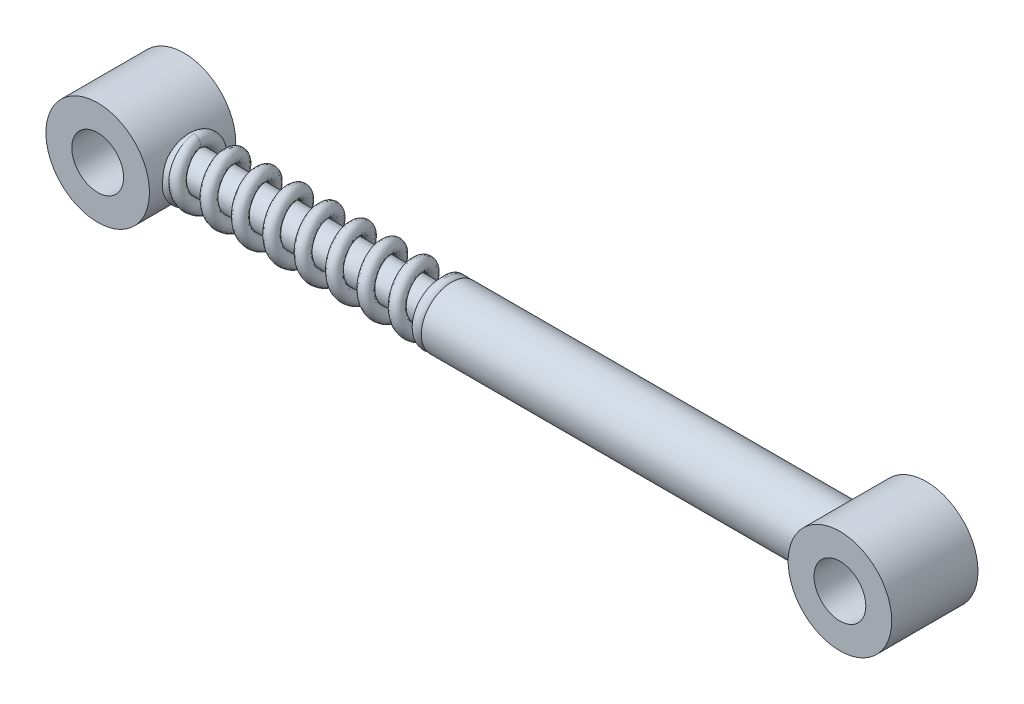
ISO-10303-21;
HEADER;
FILE_DESCRIPTION(('STEP AP214'),'2;1');
FILE_NAME('part.step','',(''),(''),'','','');
FILE_SCHEMA(('AUTOMOTIVE_DESIGN { 1 0 10303 214 1 1 1 1 }'));
ENDSEC;
DATA;
#1=APPLICATION_CONTEXT('core data for automotive mechanical design processes');
#2=APPLICATION_PROTOCOL_DEFINITION('international standard','automotive_design',2000,#1);
#3=PRODUCT_CONTEXT('',#1,'mechanical');
#4=PRODUCT('Part','Part','',(#3));
#5=PRODUCT_RELATED_PRODUCT_CATEGORY('part','',(#4));
#6=PRODUCT_DEFINITION_FORMATION('','',#4);
#7=PRODUCT_DEFINITION_CONTEXT('part definition',#1,'design');
#8=PRODUCT_DEFINITION('design','',#6,#7);
#9=PRODUCT_DEFINITION_SHAPE('','',#8);
#10=(LENGTH_UNIT() NAMED_UNIT(*) SI_UNIT(.MILLI.,.METRE.));
#11=(NAMED_UNIT(*) PLANE_ANGLE_UNIT() SI_UNIT($,.RADIAN.));
#12=(NAMED_UNIT(*) SI_UNIT($,.STERADIAN.) SOLID_ANGLE_UNIT());
#13=UNCERTAINTY_MEASURE_WITH_UNIT(LENGTH_MEASURE(1.E-05),#10,'distance_accuracy_value','');
#14=(GEOMETRIC_REPRESENTATION_CONTEXT(3) GLOBAL_UNCERTAINTY_ASSIGNED_CONTEXT((#13)) GLOBAL_UNIT_ASSIGNED_CONTEXT((#10,
#11,#12)) REPRESENTATION_CONTEXT('',''));
#15=CARTESIAN_POINT('',(0.,0.,0.));
#16=DIRECTION('',(0.,0.,1.));
#17=DIRECTION('',(1.,0.,0.));
#18=AXIS2_PLACEMENT_3D('',#15,#16,#17);
#19=CARTESIAN_POINT('',(3.45720700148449,1.375,0.));
#20=CARTESIAN_POINT('',(3.60869442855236,1.375,0.793856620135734));
#21=CARTESIAN_POINT('',(3.76018185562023,0.687499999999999,1.1907849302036));
#22=CARTESIAN_POINT('',(3.9116692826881,0.,1.58771324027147));
#23=CARTESIAN_POINT('',(4.06315670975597,-0.687499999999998,1.1907849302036));
#24=CARTESIAN_POINT('',(4.21464413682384,-1.375,0.793856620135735));
#25=CARTESIAN_POINT('',(4.36613156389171,-1.375,0.));
#26=CARTESIAN_POINT('',(4.51761899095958,-1.375,-0.793856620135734));
#27=CARTESIAN_POINT('',(4.66910641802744,-0.687499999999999,-1.1907849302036));
#28=CARTESIAN_POINT('',(4.82059384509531,0.,-1.58771324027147));
#29=CARTESIAN_POINT('',(4.97208127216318,0.687499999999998,-1.1907849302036));
#30=CARTESIAN_POINT('',(5.12356869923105,1.375,-0.793856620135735));
#31=CARTESIAN_POINT('',(5.27505612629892,1.375,0.));
#32=CARTESIAN_POINT('',(5.42654355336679,1.375,0.793856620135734));
#33=CARTESIAN_POINT('',(5.57803098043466,0.687499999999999,1.1907849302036));
#34=CARTESIAN_POINT('',(5.72951840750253,0.,1.58771324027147));
#35=CARTESIAN_POINT('',(5.8810058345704,-0.687499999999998,1.1907849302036));
#36=CARTESIAN_POINT('',(6.03249326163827,-1.375,0.793856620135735));
#37=CARTESIAN_POINT('',(6.18398068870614,-1.375,0.));
#38=CARTESIAN_POINT('',(6.33546811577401,-1.375,-0.793856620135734));
#39=CARTESIAN_POINT('',(6.48695554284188,-0.687499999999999,-1.1907849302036));
#40=CARTESIAN_POINT('',(6.63844296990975,0.,-1.58771324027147));
#41=CARTESIAN_POINT('',(6.78993039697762,0.687499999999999,-1.1907849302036));
#42=CARTESIAN_POINT('',(6.94141782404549,1.375,-0.793856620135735));
#43=CARTESIAN_POINT('',(7.09290525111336,1.375,0.));
#44=CARTESIAN_POINT('',(7.24439267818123,1.375,0.793856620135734));
#45=CARTESIAN_POINT('',(7.39588010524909,0.6875,1.1907849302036));
#46=CARTESIAN_POINT('',(7.54736753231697,0.,1.58771324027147));
#47=CARTESIAN_POINT('',(7.69885495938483,-0.687499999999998,1.1907849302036));
#48=CARTESIAN_POINT('',(7.8503423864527,-1.375,0.793856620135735));
#49=CARTESIAN_POINT('',(8.00182981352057,-1.375,0.));
#50=CARTESIAN_POINT('',(8.15331724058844,-1.375,-0.793856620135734));
#51=CARTESIAN_POINT('',(8.30480466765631,-0.687499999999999,-1.1907849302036));
#52=CARTESIAN_POINT('',(8.45629209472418,0.,-1.58771324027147));
#53=CARTESIAN_POINT('',(8.60777952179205,0.687499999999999,-1.1907849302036));
#54=CARTESIAN_POINT('',(8.75926694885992,1.375,-0.793856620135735));
#55=CARTESIAN_POINT('',(8.91075437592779,1.375,0.));
#56=CARTESIAN_POINT('',(9.06224180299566,1.375,0.793856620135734));
#57=CARTESIAN_POINT('',(9.21372923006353,0.6875,1.1907849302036));
#58=CARTESIAN_POINT('',(9.3652166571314,0.,1.58771324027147));
#59=CARTESIAN_POINT('',(9.51670408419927,-0.687499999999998,1.1907849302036));
#60=CARTESIAN_POINT('',(9.66819151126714,-1.375,0.793856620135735));
#61=CARTESIAN_POINT('',(9.81967893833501,-1.375,0.));
#62=CARTESIAN_POINT('',(9.97116636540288,-1.375,-0.793856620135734));
#63=CARTESIAN_POINT('',(10.1226537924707,-0.687499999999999,-1.1907849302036));
#64=CARTESIAN_POINT('',(10.2741412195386,0.,-1.58771324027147));
#65=CARTESIAN_POINT('',(10.4256286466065,0.687499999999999,-1.1907849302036));
#66=CARTESIAN_POINT('',(10.5771160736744,1.375,-0.793856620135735));
#67=CARTESIAN_POINT('',(10.7286035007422,1.375,0.));
#68=CARTESIAN_POINT('',(10.8800909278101,1.375,0.793856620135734));
#69=CARTESIAN_POINT('',(11.031578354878,0.6875,1.1907849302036));
#70=CARTESIAN_POINT('',(11.1830657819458,0.,1.58771324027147));
#71=CARTESIAN_POINT('',(11.3345532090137,-0.687499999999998,1.1907849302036));
#72=CARTESIAN_POINT('',(11.4860406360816,-1.375,0.793856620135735));
#73=CARTESIAN_POINT('',(11.6375280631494,-1.375,0.));
#74=CARTESIAN_POINT('',(11.7890154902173,-1.375,-0.793856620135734));
#75=CARTESIAN_POINT('',(11.9405029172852,-0.687499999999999,-1.1907849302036));
#76=CARTESIAN_POINT('',(12.0919903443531,0.,-1.58771324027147));
#77=CARTESIAN_POINT('',(12.2434777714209,0.687499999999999,-1.1907849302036));
#78=CARTESIAN_POINT('',(12.3949651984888,1.375,-0.793856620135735));
#79=CARTESIAN_POINT('',(12.5464526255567,1.375,0.));
#80=CARTESIAN_POINT('',(12.6979400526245,1.375,0.793856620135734));
#81=CARTESIAN_POINT('',(12.8494274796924,0.6875,1.1907849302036));
#82=CARTESIAN_POINT('',(13.0009149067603,0.,1.58771324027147));
#83=CARTESIAN_POINT('',(13.1524023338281,-0.687499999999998,1.1907849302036));
#84=CARTESIAN_POINT('',(13.303889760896,-1.375,0.793856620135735));
#85=CARTESIAN_POINT('',(13.4553771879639,-1.375,0.));
#86=CARTESIAN_POINT('',(13.6068646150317,-1.375,-0.793856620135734));
#87=CARTESIAN_POINT('',(13.7583520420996,-0.687499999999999,-1.1907849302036));
#88=CARTESIAN_POINT('',(13.9098394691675,0.,-1.58771324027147));
#89=CARTESIAN_POINT('',(14.0613268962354,0.687499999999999,-1.1907849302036));
#90=CARTESIAN_POINT('',(14.2128143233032,1.375,-0.793856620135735));
#91=CARTESIAN_POINT('',(14.3643017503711,1.375,0.));
#92=CARTESIAN_POINT('',(14.515789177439,1.375,0.793856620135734));
#93=CARTESIAN_POINT('',(14.6672766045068,0.6875,1.1907849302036));
#94=CARTESIAN_POINT('',(14.8187640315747,0.,1.58771324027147));
#95=CARTESIAN_POINT('',(14.9702514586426,-0.687499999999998,1.1907849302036));
#96=CARTESIAN_POINT('',(15.1217388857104,-1.375,0.793856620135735));
#97=CARTESIAN_POINT('',(15.2732263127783,-1.375,0.));
#98=CARTESIAN_POINT('',(15.4247137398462,-1.375,-0.793856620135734));
#99=CARTESIAN_POINT('',(15.576201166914,-0.687499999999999,-1.1907849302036));
#100=CARTESIAN_POINT('',(15.7276885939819,0.,-1.58771324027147));
#101=CARTESIAN_POINT('',(15.8791760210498,0.687499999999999,-1.1907849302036));
#102=CARTESIAN_POINT('',(16.0306634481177,1.375,-0.793856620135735));
#103=CARTESIAN_POINT('',(16.1821508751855,1.375,0.));
#104=CARTESIAN_POINT('',(16.3336383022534,1.375,0.793856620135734));
#105=CARTESIAN_POINT('',(16.4851257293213,0.6875,1.1907849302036));
#106=CARTESIAN_POINT('',(16.6366131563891,0.,1.58771324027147));
#107=CARTESIAN_POINT('',(16.788100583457,-0.687499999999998,1.1907849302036));
#108=CARTESIAN_POINT('',(16.9395880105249,-1.375,0.793856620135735));
#109=CARTESIAN_POINT('',(17.0910754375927,-1.375,0.));
#110=CARTESIAN_POINT('',(17.2425628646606,-1.375,-0.793856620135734));
#111=CARTESIAN_POINT('',(17.3940502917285,-0.687499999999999,-1.1907849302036));
#112=CARTESIAN_POINT('',(17.5455377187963,0.,-1.58771324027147));
#113=CARTESIAN_POINT('',(17.6970251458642,0.687499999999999,-1.1907849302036));
#114=CARTESIAN_POINT('',(17.8485125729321,1.375,-0.793856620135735));
#115=CARTESIAN_POINT('',(18.,1.375,0.));
#116=CARTESIAN_POINT('',(18.1514874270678,1.375,0.793856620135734));
#117=CARTESIAN_POINT('',(18.3029748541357,0.6875,1.1907849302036));
#118=CARTESIAN_POINT('',(18.4544622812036,0.,1.58771324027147));
#119=CARTESIAN_POINT('',(18.6059497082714,-0.687499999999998,1.1907849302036));
#120=CARTESIAN_POINT('',(18.7574371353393,-1.375,0.793856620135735));
#121=CARTESIAN_POINT('',(18.9089245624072,-1.375,0.));
#122=CARTESIAN_POINT('',(19.060411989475,-1.375,-0.793856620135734));
#123=CARTESIAN_POINT('',(19.2118994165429,-0.687499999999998,-1.1907849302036));
#124=CARTESIAN_POINT('',(19.3633868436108,0.,-1.58771324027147));
#125=CARTESIAN_POINT('',(19.5148742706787,0.687499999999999,-1.1907849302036));
#126=CARTESIAN_POINT('',(19.6663616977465,1.375,-0.793856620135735));
#127=CARTESIAN_POINT('',(19.8178491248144,1.375,0.));
#128=CARTESIAN_POINT('',(3.45720700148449,2.125,0.));
#129=CARTESIAN_POINT('',(3.60869442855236,2.125,1.22686932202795));
#130=CARTESIAN_POINT('',(3.76018185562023,1.0625,1.84030398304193));
#131=CARTESIAN_POINT('',(3.9116692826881,0.,2.45373864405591));
#132=CARTESIAN_POINT('',(4.06315670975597,-1.0625,1.84030398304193));
#133=CARTESIAN_POINT('',(4.21464413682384,-2.125,1.22686932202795));
#134=CARTESIAN_POINT('',(4.36613156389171,-2.125,0.));
#135=CARTESIAN_POINT('',(4.51761899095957,-2.125,-1.22686932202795));
#136=CARTESIAN_POINT('',(4.66910641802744,-1.0625,-1.84030398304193));
#137=CARTESIAN_POINT('',(4.82059384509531,0.,-2.45373864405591));
#138=CARTESIAN_POINT('',(4.97208127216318,1.0625,-1.84030398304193));
#139=CARTESIAN_POINT('',(5.12356869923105,2.125,-1.22686932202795));
#140=CARTESIAN_POINT('',(5.27505612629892,2.125,0.));
#141=CARTESIAN_POINT('',(5.42654355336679,2.125,1.22686932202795));
#142=CARTESIAN_POINT('',(5.57803098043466,1.0625,1.84030398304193));
#143=CARTESIAN_POINT('',(5.72951840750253,0.,2.45373864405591));
#144=CARTESIAN_POINT('',(5.8810058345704,-1.0625,1.84030398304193));
#145=CARTESIAN_POINT('',(6.03249326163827,-2.125,1.22686932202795));
#146=CARTESIAN_POINT('',(6.18398068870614,-2.125,0.));
#147=CARTESIAN_POINT('',(6.33546811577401,-2.125,-1.22686932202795));
#148=CARTESIAN_POINT('',(6.48695554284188,-1.0625,-1.84030398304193));
#149=CARTESIAN_POINT('',(6.63844296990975,0.,-2.45373864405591));
#150=CARTESIAN_POINT('',(6.78993039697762,1.0625,-1.84030398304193));
#151=CARTESIAN_POINT('',(6.94141782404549,2.125,-1.22686932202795));
#152=CARTESIAN_POINT('',(7.09290525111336,2.125,0.));
#153=CARTESIAN_POINT('',(7.24439267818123,2.125,1.22686932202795));
#154=CARTESIAN_POINT('',(7.39588010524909,1.0625,1.84030398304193));
#155=CARTESIAN_POINT('',(7.54736753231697,0.,2.45373864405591));
#156=CARTESIAN_POINT('',(7.69885495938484,-1.0625,1.84030398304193));
#157=CARTESIAN_POINT('',(7.8503423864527,-2.125,1.22686932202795));
#158=CARTESIAN_POINT('',(8.00182981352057,-2.125,0.));
#159=CARTESIAN_POINT('',(8.15331724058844,-2.125,-1.22686932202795));
#160=CARTESIAN_POINT('',(8.30480466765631,-1.0625,-1.84030398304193));
#161=CARTESIAN_POINT('',(8.45629209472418,0.,-2.45373864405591));
#162=CARTESIAN_POINT('',(8.60777952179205,1.0625,-1.84030398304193));
#163=CARTESIAN_POINT('',(8.75926694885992,2.125,-1.22686932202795));
#164=CARTESIAN_POINT('',(8.91075437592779,2.125,0.));
#165=CARTESIAN_POINT('',(9.06224180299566,2.125,1.22686932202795));
#166=CARTESIAN_POINT('',(9.21372923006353,1.0625,1.84030398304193));
#167=CARTESIAN_POINT('',(9.3652166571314,0.,2.45373864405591));
#168=CARTESIAN_POINT('',(9.51670408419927,-1.0625,1.84030398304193));
#169=CARTESIAN_POINT('',(9.66819151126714,-2.125,1.22686932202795));
#170=CARTESIAN_POINT('',(9.81967893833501,-2.125,0.));
#171=CARTESIAN_POINT('',(9.97116636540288,-2.125,-1.22686932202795));
#172=CARTESIAN_POINT('',(10.1226537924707,-1.0625,-1.84030398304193));
#173=CARTESIAN_POINT('',(10.2741412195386,0.,-2.45373864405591));
#174=CARTESIAN_POINT('',(10.4256286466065,1.0625,-1.84030398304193));
#175=CARTESIAN_POINT('',(10.5771160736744,2.125,-1.22686932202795));
#176=CARTESIAN_POINT('',(10.7286035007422,2.125,0.));
#177=CARTESIAN_POINT('',(10.8800909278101,2.125,1.22686932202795));
#178=CARTESIAN_POINT('',(11.031578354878,1.0625,1.84030398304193));
#179=CARTESIAN_POINT('',(11.1830657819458,0.,2.45373864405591));
#180=CARTESIAN_POINT('',(11.3345532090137,-1.0625,1.84030398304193));
#181=CARTESIAN_POINT('',(11.4860406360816,-2.125,1.22686932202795));
#182=CARTESIAN_POINT('',(11.6375280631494,-2.125,0.));
#183=CARTESIAN_POINT('',(11.7890154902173,-2.125,-1.22686932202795));
#184=CARTESIAN_POINT('',(11.9405029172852,-1.0625,-1.84030398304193));
#185=CARTESIAN_POINT('',(12.0919903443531,0.,-2.45373864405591));
#186=CARTESIAN_POINT('',(12.2434777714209,1.0625,-1.84030398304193));
#187=CARTESIAN_POINT('',(12.3949651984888,2.125,-1.22686932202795));
#188=CARTESIAN_POINT('',(12.5464526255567,2.125,0.));
#189=CARTESIAN_POINT('',(12.6979400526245,2.125,1.22686932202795));
#190=CARTESIAN_POINT('',(12.8494274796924,1.0625,1.84030398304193));
#191=CARTESIAN_POINT('',(13.0009149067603,0.,2.45373864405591));
#192=CARTESIAN_POINT('',(13.1524023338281,-1.0625,1.84030398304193));
#193=CARTESIAN_POINT('',(13.303889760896,-2.125,1.22686932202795));
#194=CARTESIAN_POINT('',(13.4553771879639,-2.125,0.));
#195=CARTESIAN_POINT('',(13.6068646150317,-2.125,-1.22686932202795));
#196=CARTESIAN_POINT('',(13.7583520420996,-1.0625,-1.84030398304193));
#197=CARTESIAN_POINT('',(13.9098394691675,0.,-2.45373864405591));
#198=CARTESIAN_POINT('',(14.0613268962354,1.0625,-1.84030398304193));
#199=CARTESIAN_POINT('',(14.2128143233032,2.125,-1.22686932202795));
#200=CARTESIAN_POINT('',(14.3643017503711,2.125,0.));
#201=CARTESIAN_POINT('',(14.515789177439,2.125,1.22686932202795));
#202=CARTESIAN_POINT('',(14.6672766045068,1.0625,1.84030398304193));
#203=CARTESIAN_POINT('',(14.8187640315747,0.,2.45373864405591));
#204=CARTESIAN_POINT('',(14.9702514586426,-1.0625,1.84030398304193));
#205=CARTESIAN_POINT('',(15.1217388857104,-2.12499999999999,1.22686932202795));
#206=CARTESIAN_POINT('',(15.2732263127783,-2.125,0.));
#207=CARTESIAN_POINT('',(15.4247137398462,-2.125,-1.22686932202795));
#208=CARTESIAN_POINT('',(15.576201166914,-1.0625,-1.84030398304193));
#209=CARTESIAN_POINT('',(15.7276885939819,0.,-2.45373864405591));
#210=CARTESIAN_POINT('',(15.8791760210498,1.0625,-1.84030398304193));
#211=CARTESIAN_POINT('',(16.0306634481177,2.125,-1.22686932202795));
#212=CARTESIAN_POINT('',(16.1821508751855,2.125,0.));
#213=CARTESIAN_POINT('',(16.3336383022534,2.125,1.22686932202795));
#214=CARTESIAN_POINT('',(16.4851257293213,1.0625,1.84030398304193));
#215=CARTESIAN_POINT('',(16.6366131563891,0.,2.45373864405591));
#216=CARTESIAN_POINT('',(16.788100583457,-1.0625,1.84030398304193));
#217=CARTESIAN_POINT('',(16.9395880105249,-2.12499999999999,1.22686932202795));
#218=CARTESIAN_POINT('',(17.0910754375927,-2.125,0.));
#219=CARTESIAN_POINT('',(17.2425628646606,-2.125,-1.22686932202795));
#220=CARTESIAN_POINT('',(17.3940502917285,-1.0625,-1.84030398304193));
#221=CARTESIAN_POINT('',(17.5455377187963,0.,-2.45373864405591));
#222=CARTESIAN_POINT('',(17.6970251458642,1.0625,-1.84030398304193));
#223=CARTESIAN_POINT('',(17.8485125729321,2.125,-1.22686932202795));
#224=CARTESIAN_POINT('',(18.,2.125,0.));
#225=CARTESIAN_POINT('',(18.1514874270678,2.125,1.22686932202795));
#226=CARTESIAN_POINT('',(18.3029748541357,1.0625,1.84030398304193));
#227=CARTESIAN_POINT('',(18.4544622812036,0.,2.45373864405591));
#228=CARTESIAN_POINT('',(18.6059497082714,-1.0625,1.84030398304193));
#229=CARTESIAN_POINT('',(18.7574371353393,-2.12499999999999,1.22686932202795));
#230=CARTESIAN_POINT('',(18.9089245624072,-2.125,0.));
#231=CARTESIAN_POINT('',(19.060411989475,-2.125,-1.22686932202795));
#232=CARTESIAN_POINT('',(19.2118994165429,-1.0625,-1.84030398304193));
#233=CARTESIAN_POINT('',(19.3633868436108,0.,-2.45373864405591));
#234=CARTESIAN_POINT('',(19.5148742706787,1.0625,-1.84030398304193));
#235=CARTESIAN_POINT('',(19.6663616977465,2.125,-1.22686932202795));
#236=CARTESIAN_POINT('',(19.8178491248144,2.125,0.));
#237=CARTESIAN_POINT('',(2.70720700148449,2.125,0.));
#238=CARTESIAN_POINT('',(2.85869442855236,2.125,1.22686932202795));
#239=CARTESIAN_POINT('',(3.01018185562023,1.0625,1.84030398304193));
#240=CARTESIAN_POINT('',(3.1616692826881,0.,2.45373864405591));
#241=CARTESIAN_POINT('',(3.31315670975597,-1.0625,1.84030398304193));
#242=CARTESIAN_POINT('',(3.46464413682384,-2.125,1.22686932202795));
#243=CARTESIAN_POINT('',(3.61613156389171,-2.125,0.));
#244=CARTESIAN_POINT('',(3.76761899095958,-2.125,-1.22686932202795));
#245=CARTESIAN_POINT('',(3.91910641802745,-1.0625,-1.84030398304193));
#246=CARTESIAN_POINT('',(4.07059384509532,0.,-2.45373864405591));
#247=CARTESIAN_POINT('',(4.22208127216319,1.0625,-1.84030398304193));
#248=CARTESIAN_POINT('',(4.37356869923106,2.125,-1.22686932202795));
#249=CARTESIAN_POINT('',(4.52505612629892,2.125,0.));
#250=CARTESIAN_POINT('',(4.67654355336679,2.125,1.22686932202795));
#251=CARTESIAN_POINT('',(4.82803098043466,1.0625,1.84030398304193));
#252=CARTESIAN_POINT('',(4.97951840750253,0.,2.45373864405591));
#253=CARTESIAN_POINT('',(5.1310058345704,-1.0625,1.84030398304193));
#254=CARTESIAN_POINT('',(5.28249326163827,-2.125,1.22686932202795));
#255=CARTESIAN_POINT('',(5.43398068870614,-2.125,0.));
#256=CARTESIAN_POINT('',(5.58546811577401,-2.125,-1.22686932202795));
#257=CARTESIAN_POINT('',(5.73695554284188,-1.0625,-1.84030398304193));
#258=CARTESIAN_POINT('',(5.88844296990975,0.,-2.45373864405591));
#259=CARTESIAN_POINT('',(6.03993039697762,1.0625,-1.84030398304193));
#260=CARTESIAN_POINT('',(6.19141782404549,2.125,-1.22686932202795));
#261=CARTESIAN_POINT('',(6.34290525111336,2.125,0.));
#262=CARTESIAN_POINT('',(6.49439267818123,2.125,1.22686932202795));
#263=CARTESIAN_POINT('',(6.6458801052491,1.0625,1.84030398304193));
#264=CARTESIAN_POINT('',(6.79736753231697,0.,2.45373864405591));
#265=CARTESIAN_POINT('',(6.94885495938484,-1.0625,1.84030398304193));
#266=CARTESIAN_POINT('',(7.10034238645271,-2.125,1.22686932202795));
#267=CARTESIAN_POINT('',(7.25182981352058,-2.125,0.));
#268=CARTESIAN_POINT('',(7.40331724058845,-2.125,-1.22686932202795));
#269=CARTESIAN_POINT('',(7.55480466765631,-1.0625,-1.84030398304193));
#270=CARTESIAN_POINT('',(7.70629209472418,0.,-2.45373864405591));
#271=CARTESIAN_POINT('',(7.85777952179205,1.0625,-1.84030398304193));
#272=CARTESIAN_POINT('',(8.00926694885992,2.125,-1.22686932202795));
#273=CARTESIAN_POINT('',(8.16075437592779,2.125,0.));
#274=CARTESIAN_POINT('',(8.31224180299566,2.125,1.22686932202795));
#275=CARTESIAN_POINT('',(8.46372923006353,1.0625,1.84030398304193));
#276=CARTESIAN_POINT('',(8.6152166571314,0.,2.45373864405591));
#277=CARTESIAN_POINT('',(8.76670408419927,-1.0625,1.84030398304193));
#278=CARTESIAN_POINT('',(8.91819151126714,-2.125,1.22686932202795));
#279=CARTESIAN_POINT('',(9.06967893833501,-2.125,0.));
#280=CARTESIAN_POINT('',(9.22116636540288,-2.125,-1.22686932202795));
#281=CARTESIAN_POINT('',(9.37265379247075,-1.0625,-1.84030398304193));
#282=CARTESIAN_POINT('',(9.52414121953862,0.,-2.45373864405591));
#283=CARTESIAN_POINT('',(9.67562864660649,1.0625,-1.84030398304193));
#284=CARTESIAN_POINT('',(9.82711607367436,2.125,-1.22686932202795));
#285=CARTESIAN_POINT('',(9.97860350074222,2.125,0.));
#286=CARTESIAN_POINT('',(10.1300909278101,2.125,1.22686932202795));
#287=CARTESIAN_POINT('',(10.281578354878,1.0625,1.84030398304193));
#288=CARTESIAN_POINT('',(10.4330657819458,0.,2.45373864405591));
#289=CARTESIAN_POINT('',(10.5845532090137,-1.0625,1.84030398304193));
#290=CARTESIAN_POINT('',(10.7360406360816,-2.125,1.22686932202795));
#291=CARTESIAN_POINT('',(10.8875280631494,-2.125,0.));
#292=CARTESIAN_POINT('',(11.0390154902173,-2.125,-1.22686932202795));
#293=CARTESIAN_POINT('',(11.1905029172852,-1.0625,-1.84030398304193));
#294=CARTESIAN_POINT('',(11.3419903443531,0.,-2.45373864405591));
#295=CARTESIAN_POINT('',(11.4934777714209,1.0625,-1.84030398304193));
#296=CARTESIAN_POINT('',(11.6449651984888,2.125,-1.22686932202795));
#297=CARTESIAN_POINT('',(11.7964526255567,2.125,0.));
#298=CARTESIAN_POINT('',(11.9479400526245,2.125,1.22686932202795));
#299=CARTESIAN_POINT('',(12.0994274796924,1.0625,1.84030398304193));
#300=CARTESIAN_POINT('',(12.2509149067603,0.,2.45373864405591));
#301=CARTESIAN_POINT('',(12.4024023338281,-1.0625,1.84030398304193));
#302=CARTESIAN_POINT('',(12.553889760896,-2.125,1.22686932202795));
#303=CARTESIAN_POINT('',(12.7053771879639,-2.125,0.));
#304=CARTESIAN_POINT('',(12.8568646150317,-2.125,-1.22686932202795));
#305=CARTESIAN_POINT('',(13.0083520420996,-1.0625,-1.84030398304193));
#306=CARTESIAN_POINT('',(13.1598394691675,0.,-2.45373864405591));
#307=CARTESIAN_POINT('',(13.3113268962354,1.0625,-1.84030398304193));
#308=CARTESIAN_POINT('',(13.4628143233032,2.125,-1.22686932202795));
#309=CARTESIAN_POINT('',(13.6143017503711,2.125,0.));
#310=CARTESIAN_POINT('',(13.765789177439,2.125,1.22686932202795));
#311=CARTESIAN_POINT('',(13.9172766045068,1.0625,1.84030398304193));
#312=CARTESIAN_POINT('',(14.0687640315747,0.,2.45373864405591));
#313=CARTESIAN_POINT('',(14.2202514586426,-1.0625,1.84030398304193));
#314=CARTESIAN_POINT('',(14.3717388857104,-2.125,1.22686932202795));
#315=CARTESIAN_POINT('',(14.5232263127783,-2.125,0.));
#316=CARTESIAN_POINT('',(14.6747137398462,-2.125,-1.22686932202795));
#317=CARTESIAN_POINT('',(14.8262011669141,-1.0625,-1.84030398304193));
#318=CARTESIAN_POINT('',(14.9776885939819,0.,-2.45373864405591));
#319=CARTESIAN_POINT('',(15.1291760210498,1.0625,-1.84030398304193));
#320=CARTESIAN_POINT('',(15.2806634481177,2.125,-1.22686932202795));
#321=CARTESIAN_POINT('',(15.4321508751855,2.125,0.));
#322=CARTESIAN_POINT('',(15.5836383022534,2.125,1.22686932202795));
#323=CARTESIAN_POINT('',(15.7351257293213,1.0625,1.84030398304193));
#324=CARTESIAN_POINT('',(15.8866131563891,0.,2.45373864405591));
#325=CARTESIAN_POINT('',(16.038100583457,-1.0625,1.84030398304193));
#326=CARTESIAN_POINT('',(16.1895880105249,-2.125,1.22686932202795));
#327=CARTESIAN_POINT('',(16.3410754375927,-2.125,0.));
#328=CARTESIAN_POINT('',(16.4925628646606,-2.125,-1.22686932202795));
#329=CARTESIAN_POINT('',(16.6440502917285,-1.0625,-1.84030398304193));
#330=CARTESIAN_POINT('',(16.7955377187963,0.,-2.45373864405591));
#331=CARTESIAN_POINT('',(16.9470251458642,1.0625,-1.84030398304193));
#332=CARTESIAN_POINT('',(17.0985125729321,2.125,-1.22686932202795));
#333=CARTESIAN_POINT('',(17.25,2.125,0.));
#334=CARTESIAN_POINT('',(17.4014874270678,2.125,1.22686932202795));
#335=CARTESIAN_POINT('',(17.5529748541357,1.0625,1.84030398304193));
#336=CARTESIAN_POINT('',(17.7044622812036,0.,2.45373864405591));
#337=CARTESIAN_POINT('',(17.8559497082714,-1.0625,1.84030398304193));
#338=CARTESIAN_POINT('',(18.0074371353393,-2.125,1.22686932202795));
#339=CARTESIAN_POINT('',(18.1589245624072,-2.125,0.));
#340=CARTESIAN_POINT('',(18.310411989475,-2.125,-1.22686932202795));
#341=CARTESIAN_POINT('',(18.4618994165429,-1.0625,-1.84030398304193));
#342=CARTESIAN_POINT('',(18.6133868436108,0.,-2.45373864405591));
#343=CARTESIAN_POINT('',(18.7648742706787,1.0625,-1.84030398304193));
#344=CARTESIAN_POINT('',(18.9163616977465,2.125,-1.22686932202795));
#345=CARTESIAN_POINT('',(19.0678491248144,2.125,0.));
#346=CARTESIAN_POINT('',(2.70720700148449,1.375,0.));
#347=CARTESIAN_POINT('',(2.85869442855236,1.375,0.793856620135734));
#348=CARTESIAN_POINT('',(3.01018185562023,0.687499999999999,1.1907849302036));
#349=CARTESIAN_POINT('',(3.1616692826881,0.,1.58771324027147));
#350=CARTESIAN_POINT('',(3.31315670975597,-0.687499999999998,1.1907849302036));
#351=CARTESIAN_POINT('',(3.46464413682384,-1.375,0.793856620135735));
#352=CARTESIAN_POINT('',(3.61613156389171,-1.375,0.));
#353=CARTESIAN_POINT('',(3.76761899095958,-1.375,-0.793856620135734));
#354=CARTESIAN_POINT('',(3.91910641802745,-0.687499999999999,-1.1907849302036));
#355=CARTESIAN_POINT('',(4.07059384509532,0.,-1.58771324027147));
#356=CARTESIAN_POINT('',(4.22208127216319,0.687499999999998,-1.1907849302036));
#357=CARTESIAN_POINT('',(4.37356869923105,1.375,-0.793856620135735));
#358=CARTESIAN_POINT('',(4.52505612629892,1.375,0.));
#359=CARTESIAN_POINT('',(4.67654355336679,1.375,0.793856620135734));
#360=CARTESIAN_POINT('',(4.82803098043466,0.687499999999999,1.1907849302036));
#361=CARTESIAN_POINT('',(4.97951840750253,0.,1.58771324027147));
#362=CARTESIAN_POINT('',(5.1310058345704,-0.687499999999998,1.1907849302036));
#363=CARTESIAN_POINT('',(5.28249326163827,-1.375,0.793856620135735));
#364=CARTESIAN_POINT('',(5.43398068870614,-1.375,0.));
#365=CARTESIAN_POINT('',(5.58546811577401,-1.375,-0.793856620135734));
#366=CARTESIAN_POINT('',(5.73695554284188,-0.687499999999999,-1.1907849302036));
#367=CARTESIAN_POINT('',(5.88844296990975,0.,-1.58771324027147));
#368=CARTESIAN_POINT('',(6.03993039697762,0.687499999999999,-1.1907849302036));
#369=CARTESIAN_POINT('',(6.19141782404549,1.375,-0.793856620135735));
#370=CARTESIAN_POINT('',(6.34290525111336,1.375,0.));
#371=CARTESIAN_POINT('',(6.49439267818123,1.375,0.793856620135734));
#372=CARTESIAN_POINT('',(6.6458801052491,0.6875,1.1907849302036));
#373=CARTESIAN_POINT('',(6.79736753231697,0.,1.58771324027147));
#374=CARTESIAN_POINT('',(6.94885495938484,-0.687499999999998,1.1907849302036));
#375=CARTESIAN_POINT('',(7.10034238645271,-1.375,0.793856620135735));
#376=CARTESIAN_POINT('',(7.25182981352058,-1.375,0.));
#377=CARTESIAN_POINT('',(7.40331724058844,-1.375,-0.793856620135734));
#378=CARTESIAN_POINT('',(7.55480466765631,-0.687499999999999,-1.1907849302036));
#379=CARTESIAN_POINT('',(7.70629209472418,0.,-1.58771324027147));
#380=CARTESIAN_POINT('',(7.85777952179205,0.687499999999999,-1.1907849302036));
#381=CARTESIAN_POINT('',(8.00926694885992,1.375,-0.793856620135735));
#382=CARTESIAN_POINT('',(8.16075437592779,1.375,0.));
#383=CARTESIAN_POINT('',(8.31224180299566,1.375,0.793856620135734));
#384=CARTESIAN_POINT('',(8.46372923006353,0.6875,1.1907849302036));
#385=CARTESIAN_POINT('',(8.6152166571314,0.,1.58771324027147));
#386=CARTESIAN_POINT('',(8.76670408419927,-0.687499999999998,1.1907849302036));
#387=CARTESIAN_POINT('',(8.91819151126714,-1.375,0.793856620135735));
#388=CARTESIAN_POINT('',(9.06967893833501,-1.375,0.));
#389=CARTESIAN_POINT('',(9.22116636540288,-1.375,-0.793856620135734));
#390=CARTESIAN_POINT('',(9.37265379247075,-0.687499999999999,-1.1907849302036));
#391=CARTESIAN_POINT('',(9.52414121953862,0.,-1.58771324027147));
#392=CARTESIAN_POINT('',(9.67562864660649,0.687499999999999,-1.1907849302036));
#393=CARTESIAN_POINT('',(9.82711607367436,1.375,-0.793856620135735));
#394=CARTESIAN_POINT('',(9.97860350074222,1.375,0.));
#395=CARTESIAN_POINT('',(10.1300909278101,1.375,0.793856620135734));
#396=CARTESIAN_POINT('',(10.281578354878,0.6875,1.1907849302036));
#397=CARTESIAN_POINT('',(10.4330657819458,0.,1.58771324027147));
#398=CARTESIAN_POINT('',(10.5845532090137,-0.687499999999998,1.1907849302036));
#399=CARTESIAN_POINT('',(10.7360406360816,-1.375,0.793856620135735));
#400=CARTESIAN_POINT('',(10.8875280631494,-1.375,0.));
#401=CARTESIAN_POINT('',(11.0390154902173,-1.375,-0.793856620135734));
#402=CARTESIAN_POINT('',(11.1905029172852,-0.687499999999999,-1.1907849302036));
#403=CARTESIAN_POINT('',(11.3419903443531,0.,-1.58771324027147));
#404=CARTESIAN_POINT('',(11.4934777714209,0.687499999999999,-1.1907849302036));
#405=CARTESIAN_POINT('',(11.6449651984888,1.375,-0.793856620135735));
#406=CARTESIAN_POINT('',(11.7964526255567,1.375,0.));
#407=CARTESIAN_POINT('',(11.9479400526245,1.375,0.793856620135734));
#408=CARTESIAN_POINT('',(12.0994274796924,0.6875,1.1907849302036));
#409=CARTESIAN_POINT('',(12.2509149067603,0.,1.58771324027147));
#410=CARTESIAN_POINT('',(12.4024023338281,-0.687499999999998,1.1907849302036));
#411=CARTESIAN_POINT('',(12.553889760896,-1.375,0.793856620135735));
#412=CARTESIAN_POINT('',(12.7053771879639,-1.375,0.));
#413=CARTESIAN_POINT('',(12.8568646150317,-1.375,-0.793856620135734));
#414=CARTESIAN_POINT('',(13.0083520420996,-0.687499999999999,-1.1907849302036));
#415=CARTESIAN_POINT('',(13.1598394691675,0.,-1.58771324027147));
#416=CARTESIAN_POINT('',(13.3113268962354,0.687499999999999,-1.1907849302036));
#417=CARTESIAN_POINT('',(13.4628143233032,1.375,-0.793856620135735));
#418=CARTESIAN_POINT('',(13.6143017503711,1.375,0.));
#419=CARTESIAN_POINT('',(13.765789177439,1.375,0.793856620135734));
#420=CARTESIAN_POINT('',(13.9172766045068,0.6875,1.1907849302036));
#421=CARTESIAN_POINT('',(14.0687640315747,0.,1.58771324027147));
#422=CARTESIAN_POINT('',(14.2202514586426,-0.687499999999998,1.1907849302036));
#423=CARTESIAN_POINT('',(14.3717388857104,-1.375,0.793856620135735));
#424=CARTESIAN_POINT('',(14.5232263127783,-1.375,0.));
#425=CARTESIAN_POINT('',(14.6747137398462,-1.375,-0.793856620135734));
#426=CARTESIAN_POINT('',(14.826201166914,-0.687499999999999,-1.1907849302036));
#427=CARTESIAN_POINT('',(14.9776885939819,0.,-1.58771324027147));
#428=CARTESIAN_POINT('',(15.1291760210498,0.687499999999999,-1.1907849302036));
#429=CARTESIAN_POINT('',(15.2806634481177,1.375,-0.793856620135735));
#430=CARTESIAN_POINT('',(15.4321508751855,1.375,0.));
#431=CARTESIAN_POINT('',(15.5836383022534,1.375,0.793856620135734));
#432=CARTESIAN_POINT('',(15.7351257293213,0.6875,1.1907849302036));
#433=CARTESIAN_POINT('',(15.8866131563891,0.,1.58771324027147));
#434=CARTESIAN_POINT('',(16.038100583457,-0.687499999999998,1.1907849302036));
#435=CARTESIAN_POINT('',(16.1895880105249,-1.375,0.793856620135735));
#436=CARTESIAN_POINT('',(16.3410754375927,-1.375,0.));
#437=CARTESIAN_POINT('',(16.4925628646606,-1.375,-0.793856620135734));
#438=CARTESIAN_POINT('',(16.6440502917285,-0.687499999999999,-1.1907849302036));
#439=CARTESIAN_POINT('',(16.7955377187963,0.,-1.58771324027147));
#440=CARTESIAN_POINT('',(16.9470251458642,0.687499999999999,-1.1907849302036));
#441=CARTESIAN_POINT('',(17.0985125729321,1.375,-0.793856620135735));
#442=CARTESIAN_POINT('',(17.25,1.375,0.));
#443=CARTESIAN_POINT('',(17.4014874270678,1.375,0.793856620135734));
#444=CARTESIAN_POINT('',(17.5529748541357,0.6875,1.1907849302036));
#445=CARTESIAN_POINT('',(17.7044622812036,0.,1.58771324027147));
#446=CARTESIAN_POINT('',(17.8559497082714,-0.687499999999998,1.1907849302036));
#447=CARTESIAN_POINT('',(18.0074371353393,-1.375,0.793856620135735));
#448=CARTESIAN_POINT('',(18.1589245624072,-1.375,0.));
#449=CARTESIAN_POINT('',(18.310411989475,-1.375,-0.793856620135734));
#450=CARTESIAN_POINT('',(18.4618994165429,-0.687499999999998,-1.1907849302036));
#451=CARTESIAN_POINT('',(18.6133868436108,0.,-1.58771324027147));
#452=CARTESIAN_POINT('',(18.7648742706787,0.687499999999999,-1.1907849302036));
#453=CARTESIAN_POINT('',(18.9163616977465,1.375,-0.793856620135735));
#454=CARTESIAN_POINT('',(19.0678491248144,1.375,0.));
#455=CARTESIAN_POINT('',(2.70720700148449,0.625,0.));
#456=CARTESIAN_POINT('',(2.85869442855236,0.625,0.360843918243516));
#457=CARTESIAN_POINT('',(3.01018185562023,0.3125,0.541265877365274));
#458=CARTESIAN_POINT('',(3.1616692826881,0.,0.721687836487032));
#459=CARTESIAN_POINT('',(3.31315670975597,-0.312499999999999,0.541265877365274));
#460=CARTESIAN_POINT('',(3.46464413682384,-0.624999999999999,0.360843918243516));
#461=CARTESIAN_POINT('',(3.61613156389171,-0.624999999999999,0.));
#462=CARTESIAN_POINT('',(3.76761899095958,-0.624999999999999,-0.360843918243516));
#463=CARTESIAN_POINT('',(3.91910641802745,-0.3125,-0.541265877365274));
#464=CARTESIAN_POINT('',(4.07059384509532,0.,-0.721687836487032));
#465=CARTESIAN_POINT('',(4.22208127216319,0.3125,-0.541265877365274));
#466=CARTESIAN_POINT('',(4.37356869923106,0.625,-0.360843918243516));
#467=CARTESIAN_POINT('',(4.52505612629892,0.625,0.));
#468=CARTESIAN_POINT('',(4.67654355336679,0.625,0.360843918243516));
#469=CARTESIAN_POINT('',(4.82803098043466,0.3125,0.541265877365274));
#470=CARTESIAN_POINT('',(4.97951840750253,0.,0.721687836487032));
#471=CARTESIAN_POINT('',(5.1310058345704,-0.312499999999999,0.541265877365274));
#472=CARTESIAN_POINT('',(5.28249326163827,-0.624999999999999,0.360843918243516));
#473=CARTESIAN_POINT('',(5.43398068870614,-0.624999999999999,0.));
#474=CARTESIAN_POINT('',(5.58546811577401,-0.624999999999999,-0.360843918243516));
#475=CARTESIAN_POINT('',(5.73695554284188,-0.3125,-0.541265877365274));
#476=CARTESIAN_POINT('',(5.88844296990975,0.,-0.721687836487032));
#477=CARTESIAN_POINT('',(6.03993039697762,0.3125,-0.541265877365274));
#478=CARTESIAN_POINT('',(6.19141782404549,0.625,-0.360843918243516));
#479=CARTESIAN_POINT('',(6.34290525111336,0.625,0.));
#480=CARTESIAN_POINT('',(6.49439267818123,0.625,0.360843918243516));
#481=CARTESIAN_POINT('',(6.6458801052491,0.3125,0.541265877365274));
#482=CARTESIAN_POINT('',(6.79736753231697,0.,0.721687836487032));
#483=CARTESIAN_POINT('',(6.94885495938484,-0.312499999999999,0.541265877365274));
#484=CARTESIAN_POINT('',(7.10034238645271,-0.624999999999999,0.360843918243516));
#485=CARTESIAN_POINT('',(7.25182981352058,-0.624999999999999,0.));
#486=CARTESIAN_POINT('',(7.40331724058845,-0.624999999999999,-0.360843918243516));
#487=CARTESIAN_POINT('',(7.55480466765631,-0.3125,-0.541265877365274));
#488=CARTESIAN_POINT('',(7.70629209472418,0.,-0.721687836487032));
#489=CARTESIAN_POINT('',(7.85777952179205,0.3125,-0.541265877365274));
#490=CARTESIAN_POINT('',(8.00926694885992,0.625,-0.360843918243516));
#491=CARTESIAN_POINT('',(8.16075437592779,0.625,0.));
#492=CARTESIAN_POINT('',(8.31224180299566,0.625,0.360843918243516));
#493=CARTESIAN_POINT('',(8.46372923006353,0.3125,0.541265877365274));
#494=CARTESIAN_POINT('',(8.6152166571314,0.,0.721687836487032));
#495=CARTESIAN_POINT('',(8.76670408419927,-0.312499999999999,0.541265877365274));
#496=CARTESIAN_POINT('',(8.91819151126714,-0.624999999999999,0.360843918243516));
#497=CARTESIAN_POINT('',(9.06967893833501,-0.624999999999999,0.));
#498=CARTESIAN_POINT('',(9.22116636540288,-0.624999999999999,-0.360843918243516));
#499=CARTESIAN_POINT('',(9.37265379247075,-0.3125,-0.541265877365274));
#500=CARTESIAN_POINT('',(9.52414121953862,0.,-0.721687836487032));
#501=CARTESIAN_POINT('',(9.67562864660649,0.3125,-0.541265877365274));
#502=CARTESIAN_POINT('',(9.82711607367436,0.625,-0.360843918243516));
#503=CARTESIAN_POINT('',(9.97860350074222,0.625,0.));
#504=CARTESIAN_POINT('',(10.1300909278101,0.625,0.360843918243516));
#505=CARTESIAN_POINT('',(10.281578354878,0.312500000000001,0.541265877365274));
#506=CARTESIAN_POINT('',(10.4330657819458,0.,0.721687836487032));
#507=CARTESIAN_POINT('',(10.5845532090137,-0.312499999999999,0.541265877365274));
#508=CARTESIAN_POINT('',(10.7360406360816,-0.624999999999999,0.360843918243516));
#509=CARTESIAN_POINT('',(10.8875280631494,-0.624999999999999,0.));
#510=CARTESIAN_POINT('',(11.0390154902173,-0.624999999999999,-0.360843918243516));
#511=CARTESIAN_POINT('',(11.1905029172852,-0.312499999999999,-0.541265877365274));
#512=CARTESIAN_POINT('',(11.3419903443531,0.,-0.721687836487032));
#513=CARTESIAN_POINT('',(11.4934777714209,0.3125,-0.541265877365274));
#514=CARTESIAN_POINT('',(11.6449651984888,0.625,-0.360843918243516));
#515=CARTESIAN_POINT('',(11.7964526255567,0.625,0.));
#516=CARTESIAN_POINT('',(11.9479400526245,0.625000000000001,0.360843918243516));
#517=CARTESIAN_POINT('',(12.0994274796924,0.312500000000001,0.541265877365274));
#518=CARTESIAN_POINT('',(12.2509149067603,0.,0.721687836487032));
#519=CARTESIAN_POINT('',(12.4024023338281,-0.312499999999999,0.541265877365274));
#520=CARTESIAN_POINT('',(12.553889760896,-0.624999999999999,0.360843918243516));
#521=CARTESIAN_POINT('',(12.7053771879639,-0.624999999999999,0.));
#522=CARTESIAN_POINT('',(12.8568646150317,-0.624999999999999,-0.360843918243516));
#523=CARTESIAN_POINT('',(13.0083520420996,-0.312499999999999,-0.541265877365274));
#524=CARTESIAN_POINT('',(13.1598394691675,0.,-0.721687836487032));
#525=CARTESIAN_POINT('',(13.3113268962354,0.3125,-0.541265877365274));
#526=CARTESIAN_POINT('',(13.4628143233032,0.625,-0.360843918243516));
#527=CARTESIAN_POINT('',(13.6143017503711,0.625000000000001,0.));
#528=CARTESIAN_POINT('',(13.765789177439,0.625000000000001,0.360843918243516));
#529=CARTESIAN_POINT('',(13.9172766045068,0.312500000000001,0.541265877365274));
#530=CARTESIAN_POINT('',(14.0687640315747,0.,0.721687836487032));
#531=CARTESIAN_POINT('',(14.2202514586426,-0.312499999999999,0.541265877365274));
#532=CARTESIAN_POINT('',(14.3717388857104,-0.624999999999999,0.360843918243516));
#533=CARTESIAN_POINT('',(14.5232263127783,-0.624999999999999,0.));
#534=CARTESIAN_POINT('',(14.6747137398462,-0.624999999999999,-0.360843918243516));
#535=CARTESIAN_POINT('',(14.8262011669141,-0.312499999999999,-0.541265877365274));
#536=CARTESIAN_POINT('',(14.9776885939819,0.,-0.721687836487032));
#537=CARTESIAN_POINT('',(15.1291760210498,0.3125,-0.541265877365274));
#538=CARTESIAN_POINT('',(15.2806634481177,0.625000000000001,-0.360843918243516));
#539=CARTESIAN_POINT('',(15.4321508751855,0.625000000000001,0.));
#540=CARTESIAN_POINT('',(15.5836383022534,0.625000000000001,0.360843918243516));
#541=CARTESIAN_POINT('',(15.7351257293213,0.312500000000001,0.541265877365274));
#542=CARTESIAN_POINT('',(15.8866131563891,0.,0.721687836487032));
#543=CARTESIAN_POINT('',(16.038100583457,-0.312499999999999,0.541265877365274));
#544=CARTESIAN_POINT('',(16.1895880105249,-0.624999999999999,0.360843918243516));
#545=CARTESIAN_POINT('',(16.3410754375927,-0.624999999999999,0.));
#546=CARTESIAN_POINT('',(16.4925628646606,-0.624999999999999,-0.360843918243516));
#547=CARTESIAN_POINT('',(16.6440502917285,-0.312499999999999,-0.541265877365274));
#548=CARTESIAN_POINT('',(16.7955377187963,0.,-0.721687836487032));
#549=CARTESIAN_POINT('',(16.9470251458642,0.3125,-0.541265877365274));
#550=CARTESIAN_POINT('',(17.0985125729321,0.625000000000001,-0.360843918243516));
#551=CARTESIAN_POINT('',(17.25,0.625000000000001,0.));
#552=CARTESIAN_POINT('',(17.4014874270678,0.625000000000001,0.360843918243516));
#553=CARTESIAN_POINT('',(17.5529748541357,0.312500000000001,0.541265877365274));
#554=CARTESIAN_POINT('',(17.7044622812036,0.,0.721687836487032));
#555=CARTESIAN_POINT('',(17.8559497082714,-0.312499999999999,0.541265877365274));
#556=CARTESIAN_POINT('',(18.0074371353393,-0.624999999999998,0.360843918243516));
#557=CARTESIAN_POINT('',(18.1589245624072,-0.624999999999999,0.));
#558=CARTESIAN_POINT('',(18.310411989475,-0.624999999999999,-0.360843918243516));
#559=CARTESIAN_POINT('',(18.4618994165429,-0.312499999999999,-0.541265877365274));
#560=CARTESIAN_POINT('',(18.6133868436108,0.,-0.721687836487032));
#561=CARTESIAN_POINT('',(18.7648742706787,0.312500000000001,-0.541265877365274));
#562=CARTESIAN_POINT('',(18.9163616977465,0.625000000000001,-0.360843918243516));
#563=CARTESIAN_POINT('',(19.0678491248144,0.625000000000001,0.));
#564=CARTESIAN_POINT('',(3.45720700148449,0.625,0.));
#565=CARTESIAN_POINT('',(3.60869442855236,0.625,0.360843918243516));
#566=CARTESIAN_POINT('',(3.76018185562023,0.3125,0.541265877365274));
#567=CARTESIAN_POINT('',(3.9116692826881,0.,0.721687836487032));
#568=CARTESIAN_POINT('',(4.06315670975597,-0.312499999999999,0.541265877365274));
#569=CARTESIAN_POINT('',(4.21464413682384,-0.624999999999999,0.360843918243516));
#570=CARTESIAN_POINT('',(4.36613156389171,-0.624999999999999,0.));
#571=CARTESIAN_POINT('',(4.51761899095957,-0.624999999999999,-0.360843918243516));
#572=CARTESIAN_POINT('',(4.66910641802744,-0.3125,-0.541265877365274));
#573=CARTESIAN_POINT('',(4.82059384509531,0.,-0.721687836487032));
#574=CARTESIAN_POINT('',(4.97208127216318,0.3125,-0.541265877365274));
#575=CARTESIAN_POINT('',(5.12356869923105,0.625,-0.360843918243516));
#576=CARTESIAN_POINT('',(5.27505612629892,0.625,0.));
#577=CARTESIAN_POINT('',(5.42654355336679,0.625,0.360843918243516));
#578=CARTESIAN_POINT('',(5.57803098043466,0.3125,0.541265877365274));
#579=CARTESIAN_POINT('',(5.72951840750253,0.,0.721687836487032));
#580=CARTESIAN_POINT('',(5.8810058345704,-0.312499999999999,0.541265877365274));
#581=CARTESIAN_POINT('',(6.03249326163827,-0.624999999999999,0.360843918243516));
#582=CARTESIAN_POINT('',(6.18398068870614,-0.624999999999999,0.));
#583=CARTESIAN_POINT('',(6.33546811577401,-0.624999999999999,-0.360843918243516));
#584=CARTESIAN_POINT('',(6.48695554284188,-0.3125,-0.541265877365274));
#585=CARTESIAN_POINT('',(6.63844296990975,0.,-0.721687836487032));
#586=CARTESIAN_POINT('',(6.78993039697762,0.3125,-0.541265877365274));
#587=CARTESIAN_POINT('',(6.94141782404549,0.625,-0.360843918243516));
#588=CARTESIAN_POINT('',(7.09290525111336,0.625,0.));
#589=CARTESIAN_POINT('',(7.24439267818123,0.625,0.360843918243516));
#590=CARTESIAN_POINT('',(7.39588010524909,0.3125,0.541265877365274));
#591=CARTESIAN_POINT('',(7.54736753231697,0.,0.721687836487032));
#592=CARTESIAN_POINT('',(7.69885495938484,-0.312499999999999,0.541265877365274));
#593=CARTESIAN_POINT('',(7.8503423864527,-0.624999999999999,0.360843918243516));
#594=CARTESIAN_POINT('',(8.00182981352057,-0.624999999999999,0.));
#595=CARTESIAN_POINT('',(8.15331724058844,-0.624999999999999,-0.360843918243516));
#596=CARTESIAN_POINT('',(8.30480466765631,-0.3125,-0.541265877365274));
#597=CARTESIAN_POINT('',(8.45629209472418,0.,-0.721687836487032));
#598=CARTESIAN_POINT('',(8.60777952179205,0.3125,-0.541265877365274));
#599=CARTESIAN_POINT('',(8.75926694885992,0.625,-0.360843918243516));
#600=CARTESIAN_POINT('',(8.91075437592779,0.625,0.));
#601=CARTESIAN_POINT('',(9.06224180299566,0.625,0.360843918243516));
#602=CARTESIAN_POINT('',(9.21372923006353,0.3125,0.541265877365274));
#603=CARTESIAN_POINT('',(9.3652166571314,0.,0.721687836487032));
#604=CARTESIAN_POINT('',(9.51670408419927,-0.312499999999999,0.541265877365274));
#605=CARTESIAN_POINT('',(9.66819151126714,-0.624999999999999,0.360843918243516));
#606=CARTESIAN_POINT('',(9.81967893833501,-0.624999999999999,0.));
#607=CARTESIAN_POINT('',(9.97116636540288,-0.624999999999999,-0.360843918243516));
#608=CARTESIAN_POINT('',(10.1226537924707,-0.3125,-0.541265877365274));
#609=CARTESIAN_POINT('',(10.2741412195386,0.,-0.721687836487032));
#610=CARTESIAN_POINT('',(10.4256286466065,0.3125,-0.541265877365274));
#611=CARTESIAN_POINT('',(10.5771160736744,0.625,-0.360843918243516));
#612=CARTESIAN_POINT('',(10.7286035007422,0.625,0.));
#613=CARTESIAN_POINT('',(10.8800909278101,0.625,0.360843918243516));
#614=CARTESIAN_POINT('',(11.031578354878,0.312500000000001,0.541265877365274));
#615=CARTESIAN_POINT('',(11.1830657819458,0.,0.721687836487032));
#616=CARTESIAN_POINT('',(11.3345532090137,-0.312499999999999,0.541265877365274));
#617=CARTESIAN_POINT('',(11.4860406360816,-0.624999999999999,0.360843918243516));
#618=CARTESIAN_POINT('',(11.6375280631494,-0.624999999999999,0.));
#619=CARTESIAN_POINT('',(11.7890154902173,-0.624999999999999,-0.360843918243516));
#620=CARTESIAN_POINT('',(11.9405029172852,-0.312499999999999,-0.541265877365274));
#621=CARTESIAN_POINT('',(12.0919903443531,0.,-0.721687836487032));
#622=CARTESIAN_POINT('',(12.2434777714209,0.3125,-0.541265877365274));
#623=CARTESIAN_POINT('',(12.3949651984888,0.625,-0.360843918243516));
#624=CARTESIAN_POINT('',(12.5464526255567,0.625,0.));
#625=CARTESIAN_POINT('',(12.6979400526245,0.625000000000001,0.360843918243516));
#626=CARTESIAN_POINT('',(12.8494274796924,0.312500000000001,0.541265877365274));
#627=CARTESIAN_POINT('',(13.0009149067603,0.,0.721687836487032));
#628=CARTESIAN_POINT('',(13.1524023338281,-0.312499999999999,0.541265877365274));
#629=CARTESIAN_POINT('',(13.303889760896,-0.624999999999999,0.360843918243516));
#630=CARTESIAN_POINT('',(13.4553771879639,-0.624999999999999,0.));
#631=CARTESIAN_POINT('',(13.6068646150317,-0.624999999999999,-0.360843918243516));
#632=CARTESIAN_POINT('',(13.7583520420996,-0.312499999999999,-0.541265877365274));
#633=CARTESIAN_POINT('',(13.9098394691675,0.,-0.721687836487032));
#634=CARTESIAN_POINT('',(14.0613268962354,0.3125,-0.541265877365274));
#635=CARTESIAN_POINT('',(14.2128143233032,0.625,-0.360843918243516));
#636=CARTESIAN_POINT('',(14.3643017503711,0.625000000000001,0.));
#637=CARTESIAN_POINT('',(14.515789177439,0.625000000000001,0.360843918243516));
#638=CARTESIAN_POINT('',(14.6672766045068,0.312500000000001,0.541265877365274));
#639=CARTESIAN_POINT('',(14.8187640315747,0.,0.721687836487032));
#640=CARTESIAN_POINT('',(14.9702514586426,-0.312499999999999,0.541265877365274));
#641=CARTESIAN_POINT('',(15.1217388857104,-0.624999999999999,0.360843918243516));
#642=CARTESIAN_POINT('',(15.2732263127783,-0.624999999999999,0.));
#643=CARTESIAN_POINT('',(15.4247137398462,-0.624999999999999,-0.360843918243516));
#644=CARTESIAN_POINT('',(15.576201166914,-0.312499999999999,-0.541265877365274));
#645=CARTESIAN_POINT('',(15.7276885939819,0.,-0.721687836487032));
#646=CARTESIAN_POINT('',(15.8791760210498,0.3125,-0.541265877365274));
#647=CARTESIAN_POINT('',(16.0306634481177,0.625000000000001,-0.360843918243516));
#648=CARTESIAN_POINT('',(16.1821508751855,0.625000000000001,0.));
#649=CARTESIAN_POINT('',(16.3336383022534,0.625000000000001,0.360843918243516));
#650=CARTESIAN_POINT('',(16.4851257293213,0.312500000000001,0.541265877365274));
#651=CARTESIAN_POINT('',(16.6366131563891,0.,0.721687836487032));
#652=CARTESIAN_POINT('',(16.788100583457,-0.312499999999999,0.541265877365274));
#653=CARTESIAN_POINT('',(16.9395880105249,-0.624999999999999,0.360843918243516));
#654=CARTESIAN_POINT('',(17.0910754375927,-0.624999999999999,0.));
#655=CARTESIAN_POINT('',(17.2425628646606,-0.624999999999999,-0.360843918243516));
#656=CARTESIAN_POINT('',(17.3940502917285,-0.312499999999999,-0.541265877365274));
#657=CARTESIAN_POINT('',(17.5455377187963,0.,-0.721687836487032));
#658=CARTESIAN_POINT('',(17.6970251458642,0.3125,-0.541265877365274));
#659=CARTESIAN_POINT('',(17.8485125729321,0.625000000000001,-0.360843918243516));
#660=CARTESIAN_POINT('',(18.,0.625000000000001,0.));
#661=CARTESIAN_POINT('',(18.1514874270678,0.625000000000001,0.360843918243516));
#662=CARTESIAN_POINT('',(18.3029748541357,0.312500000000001,0.541265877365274));
#663=CARTESIAN_POINT('',(18.4544622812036,0.,0.721687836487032));
#664=CARTESIAN_POINT('',(18.6059497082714,-0.312499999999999,0.541265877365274));
#665=CARTESIAN_POINT('',(18.7574371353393,-0.624999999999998,0.360843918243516));
#666=CARTESIAN_POINT('',(18.9089245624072,-0.624999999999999,0.));
#667=CARTESIAN_POINT('',(19.060411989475,-0.624999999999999,-0.360843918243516));
#668=CARTESIAN_POINT('',(19.2118994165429,-0.312499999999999,-0.541265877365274));
#669=CARTESIAN_POINT('',(19.3633868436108,0.,-0.721687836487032));
#670=CARTESIAN_POINT('',(19.5148742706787,0.312500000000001,-0.541265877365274));
#671=CARTESIAN_POINT('',(19.6663616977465,0.625000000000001,-0.360843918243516));
#672=CARTESIAN_POINT('',(19.8178491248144,0.625000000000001,0.));
#673=CARTESIAN_POINT('',(3.45720700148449,1.375,0.));
#674=CARTESIAN_POINT('',(3.60869442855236,1.375,0.793856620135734));
#675=CARTESIAN_POINT('',(3.76018185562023,0.687499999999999,1.1907849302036));
#676=CARTESIAN_POINT('',(3.9116692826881,0.,1.58771324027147));
#677=CARTESIAN_POINT('',(4.06315670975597,-0.687499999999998,1.1907849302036));
#678=CARTESIAN_POINT('',(4.21464413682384,-1.375,0.793856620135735));
#679=CARTESIAN_POINT('',(4.36613156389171,-1.375,0.));
#680=CARTESIAN_POINT('',(4.51761899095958,-1.375,-0.793856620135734));
#681=CARTESIAN_POINT('',(4.66910641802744,-0.687499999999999,-1.1907849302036));
#682=CARTESIAN_POINT('',(4.82059384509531,0.,-1.58771324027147));
#683=CARTESIAN_POINT('',(4.97208127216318,0.687499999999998,-1.1907849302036));
#684=CARTESIAN_POINT('',(5.12356869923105,1.375,-0.793856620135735));
#685=CARTESIAN_POINT('',(5.27505612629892,1.375,0.));
#686=CARTESIAN_POINT('',(5.42654355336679,1.375,0.793856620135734));
#687=CARTESIAN_POINT('',(5.57803098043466,0.687499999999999,1.1907849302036));
#688=CARTESIAN_POINT('',(5.72951840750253,0.,1.58771324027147));
#689=CARTESIAN_POINT('',(5.8810058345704,-0.687499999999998,1.1907849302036));
#690=CARTESIAN_POINT('',(6.03249326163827,-1.375,0.793856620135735));
#691=CARTESIAN_POINT('',(6.18398068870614,-1.375,0.));
#692=CARTESIAN_POINT('',(6.33546811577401,-1.375,-0.793856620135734));
#693=CARTESIAN_POINT('',(6.48695554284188,-0.687499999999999,-1.1907849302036));
#694=CARTESIAN_POINT('',(6.63844296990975,0.,-1.58771324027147));
#695=CARTESIAN_POINT('',(6.78993039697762,0.687499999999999,-1.1907849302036));
#696=CARTESIAN_POINT('',(6.94141782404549,1.375,-0.793856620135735));
#697=CARTESIAN_POINT('',(7.09290525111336,1.375,0.));
#698=CARTESIAN_POINT('',(7.24439267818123,1.375,0.793856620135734));
#699=CARTESIAN_POINT('',(7.39588010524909,0.6875,1.1907849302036));
#700=CARTESIAN_POINT('',(7.54736753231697,0.,1.58771324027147));
#701=CARTESIAN_POINT('',(7.69885495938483,-0.687499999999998,1.1907849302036));
#702=CARTESIAN_POINT('',(7.8503423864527,-1.375,0.793856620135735));
#703=CARTESIAN_POINT('',(8.00182981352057,-1.375,0.));
#704=CARTESIAN_POINT('',(8.15331724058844,-1.375,-0.793856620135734));
#705=CARTESIAN_POINT('',(8.30480466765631,-0.687499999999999,-1.1907849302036));
#706=CARTESIAN_POINT('',(8.45629209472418,0.,-1.58771324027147));
#707=CARTESIAN_POINT('',(8.60777952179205,0.687499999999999,-1.1907849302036));
#708=CARTESIAN_POINT('',(8.75926694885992,1.375,-0.793856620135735));
#709=CARTESIAN_POINT('',(8.91075437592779,1.375,0.));
#710=CARTESIAN_POINT('',(9.06224180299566,1.375,0.793856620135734));
#711=CARTESIAN_POINT('',(9.21372923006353,0.6875,1.1907849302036));
#712=CARTESIAN_POINT('',(9.3652166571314,0.,1.58771324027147));
#713=CARTESIAN_POINT('',(9.51670408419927,-0.687499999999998,1.1907849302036));
#714=CARTESIAN_POINT('',(9.66819151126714,-1.375,0.793856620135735));
#715=CARTESIAN_POINT('',(9.81967893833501,-1.375,0.));
#716=CARTESIAN_POINT('',(9.97116636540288,-1.375,-0.793856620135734));
#717=CARTESIAN_POINT('',(10.1226537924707,-0.687499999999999,-1.1907849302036));
#718=CARTESIAN_POINT('',(10.2741412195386,0.,-1.58771324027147));
#719=CARTESIAN_POINT('',(10.4256286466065,0.687499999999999,-1.1907849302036));
#720=CARTESIAN_POINT('',(10.5771160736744,1.375,-0.793856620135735));
#721=CARTESIAN_POINT('',(10.7286035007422,1.375,0.));
#722=CARTESIAN_POINT('',(10.8800909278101,1.375,0.793856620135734));
#723=CARTESIAN_POINT('',(11.031578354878,0.6875,1.1907849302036));
#724=CARTESIAN_POINT('',(11.1830657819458,0.,1.58771324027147));
#725=CARTESIAN_POINT('',(11.3345532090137,-0.687499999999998,1.1907849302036));
#726=CARTESIAN_POINT('',(11.4860406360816,-1.375,0.793856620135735));
#727=CARTESIAN_POINT('',(11.6375280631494,-1.375,0.));
#728=CARTESIAN_POINT('',(11.7890154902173,-1.375,-0.793856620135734));
#729=CARTESIAN_POINT('',(11.9405029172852,-0.687499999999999,-1.1907849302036));
#730=CARTESIAN_POINT('',(12.0919903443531,0.,-1.58771324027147));
#731=CARTESIAN_POINT('',(12.2434777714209,0.687499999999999,-1.1907849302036));
#732=CARTESIAN_POINT('',(12.3949651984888,1.375,-0.793856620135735));
#733=CARTESIAN_POINT('',(12.5464526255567,1.375,0.));
#734=CARTESIAN_POINT('',(12.6979400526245,1.375,0.793856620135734));
#735=CARTESIAN_POINT('',(12.8494274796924,0.6875,1.1907849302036));
#736=CARTESIAN_POINT('',(13.0009149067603,0.,1.58771324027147));
#737=CARTESIAN_POINT('',(13.1524023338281,-0.687499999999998,1.1907849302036));
#738=CARTESIAN_POINT('',(13.303889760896,-1.375,0.793856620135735));
#739=CARTESIAN_POINT('',(13.4553771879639,-1.375,0.));
#740=CARTESIAN_POINT('',(13.6068646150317,-1.375,-0.793856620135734));
#741=CARTESIAN_POINT('',(13.7583520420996,-0.687499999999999,-1.1907849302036));
#742=CARTESIAN_POINT('',(13.9098394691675,0.,-1.58771324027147));
#743=CARTESIAN_POINT('',(14.0613268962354,0.687499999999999,-1.1907849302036));
#744=CARTESIAN_POINT('',(14.2128143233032,1.375,-0.793856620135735));
#745=CARTESIAN_POINT('',(14.3643017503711,1.375,0.));
#746=CARTESIAN_POINT('',(14.515789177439,1.375,0.793856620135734));
#747=CARTESIAN_POINT('',(14.6672766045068,0.6875,1.1907849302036));
#748=CARTESIAN_POINT('',(14.8187640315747,0.,1.58771324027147));
#749=CARTESIAN_POINT('',(14.9702514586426,-0.687499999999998,1.1907849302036));
#750=CARTESIAN_POINT('',(15.1217388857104,-1.375,0.793856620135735));
#751=CARTESIAN_POINT('',(15.2732263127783,-1.375,0.));
#752=CARTESIAN_POINT('',(15.4247137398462,-1.375,-0.793856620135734));
#753=CARTESIAN_POINT('',(15.576201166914,-0.687499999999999,-1.1907849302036));
#754=CARTESIAN_POINT('',(15.7276885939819,0.,-1.58771324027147));
#755=CARTESIAN_POINT('',(15.8791760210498,0.687499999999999,-1.1907849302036));
#756=CARTESIAN_POINT('',(16.0306634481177,1.375,-0.793856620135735));
#757=CARTESIAN_POINT('',(16.1821508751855,1.375,0.));
#758=CARTESIAN_POINT('',(16.3336383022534,1.375,0.793856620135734));
#759=CARTESIAN_POINT('',(16.4851257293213,0.6875,1.1907849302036));
#760=CARTESIAN_POINT('',(16.6366131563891,0.,1.58771324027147));
#761=CARTESIAN_POINT('',(16.788100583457,-0.687499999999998,1.1907849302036));
#762=CARTESIAN_POINT('',(16.9395880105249,-1.375,0.793856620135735));
#763=CARTESIAN_POINT('',(17.0910754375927,-1.375,0.));
#764=CARTESIAN_POINT('',(17.2425628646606,-1.375,-0.793856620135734));
#765=CARTESIAN_POINT('',(17.3940502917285,-0.687499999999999,-1.1907849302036));
#766=CARTESIAN_POINT('',(17.5455377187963,0.,-1.58771324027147));
#767=CARTESIAN_POINT('',(17.6970251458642,0.687499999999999,-1.1907849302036));
#768=CARTESIAN_POINT('',(17.8485125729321,1.375,-0.793856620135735));
#769=CARTESIAN_POINT('',(18.,1.375,0.));
#770=CARTESIAN_POINT('',(18.1514874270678,1.375,0.793856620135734));
#771=CARTESIAN_POINT('',(18.3029748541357,0.6875,1.1907849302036));
#772=CARTESIAN_POINT('',(18.4544622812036,0.,1.58771324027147));
#773=CARTESIAN_POINT('',(18.6059497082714,-0.687499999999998,1.1907849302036));
#774=CARTESIAN_POINT('',(18.7574371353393,-1.375,0.793856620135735));
#775=CARTESIAN_POINT('',(18.9089245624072,-1.375,0.));
#776=CARTESIAN_POINT('',(19.060411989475,-1.375,-0.793856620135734));
#777=CARTESIAN_POINT('',(19.2118994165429,-0.687499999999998,-1.1907849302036));
#778=CARTESIAN_POINT('',(19.3633868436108,0.,-1.58771324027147));
#779=CARTESIAN_POINT('',(19.5148742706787,0.687499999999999,-1.1907849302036));
#780=CARTESIAN_POINT('',(19.6663616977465,1.375,-0.793856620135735));
#781=CARTESIAN_POINT('',(19.8178491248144,1.375,0.));
#782=(BOUNDED_SURFACE() B_SPLINE_SURFACE(3,2,((#19,#20,#21,#22,#23,#24,#25,#26,#27,#28,#29,#30,
#31,#32,#33,#34,#35,#36,#37,#38,#39,#40,#41,#42,#43,#44,#45,#46,#47,#48,#49,#50,#51,#52,#53,#54,
#55,#56,#57,#58,#59,#60,#61,#62,#63,#64,#65,#66,#67,#68,#69,#70,#71,#72,#73,#74,#75,#76,#77,#78,
#79,#80,#81,#82,#83,#84,#85,#86,#87,#88,#89,#90,#91,#92,#93,#94,#95,#96,#97,#98,#99,#100,#101,
#102,#103,#104,#105,#106,#107,#108,#109,#110,#111,#112,#113,#114,#115,#116,#117,#118,#119,#120,
#121,#122,#123,#124,#125,#126,#127),(#128,#129,#130,#131,#132,#133,#134,#135,#136,#137,#138,
#139,#140,#141,#142,#143,#144,#145,#146,#147,#148,#149,#150,#151,#152,#153,#154,#155,#156,#157,
#158,#159,#160,#161,#162,#163,#164,#165,#166,#167,#168,#169,#170,#171,#172,#173,#174,#175,#176,
#177,#178,#179,#180,#181,#182,#183,#184,#185,#186,#187,#188,#189,#190,#191,#192,#193,#194,#195,
#196,#197,#198,#199,#200,#201,#202,#203,#204,#205,#206,#207,#208,#209,#210,#211,#212,#213,#214,
#215,#216,#217,#218,#219,#220,#221,#222,#223,#224,#225,#226,#227,#228,#229,#230,#231,#232,#233,
#234,#235,#236),(#237,#238,#239,#240,#241,#242,#243,#244,#245,#246,#247,#248,#249,#250,#251,
#252,#253,#254,#255,#256,#257,#258,#259,#260,#261,#262,#263,#264,#265,#266,#267,#268,#269,#270,
#271,#272,#273,#274,#275,#276,#277,#278,#279,#280,#281,#282,#283,#284,#285,#286,#287,#288,#289,
#290,#291,#292,#293,#294,#295,#296,#297,#298,#299,#300,#301,#302,#303,#304,#305,#306,#307,#308,
#309,#310,#311,#312,#313,#314,#315,#316,#317,#318,#319,#320,#321,#322,#323,#324,#325,#326,#327,
#328,#329,#330,#331,#332,#333,#334,#335,#336,#337,#338,#339,#340,#341,#342,#343,#344,#345),
(#346,#347,#348,#349,#350,#351,#352,#353,#354,#355,#356,#357,#358,#359,#360,#361,#362,#363,#364,
#365,#366,#367,#368,#369,#370,#371,#372,#373,#374,#375,#376,#377,#378,#379,#380,#381,#382,#383,
#384,#385,#386,#387,#388,#389,#390,#391,#392,#393,#394,#395,#396,#397,#398,#399,#400,#401,#402,
#403,#404,#405,#406,#407,#408,#409,#410,#411,#412,#413,#414,#415,#416,#417,#418,#419,#420,#421,
#422,#423,#424,#425,#426,#427,#428,#429,#430,#431,#432,#433,#434,#435,#436,#437,#438,#439,#440,
#441,#442,#443,#444,#445,#446,#447,#448,#449,#450,#451,#452,#453,#454),(#455,#456,#457,#458,
#459,#460,#461,#462,#463,#464,#465,#466,#467,#468,#469,#470,#471,#472,#473,#474,#475,#476,#477,
#478,#479,#480,#481,#482,#483,#484,#485,#486,#487,#488,#489,#490,#491,#492,#493,#494,#495,#496,
#497,#498,#499,#500,#501,#502,#503,#504,#505,#506,#507,#508,#509,#510,#511,#512,#513,#514,#515,
#516,#517,#518,#519,#520,#521,#522,#523,#524,#525,#526,#527,#528,#529,#530,#531,#532,#533,#534,
#535,#536,#537,#538,#539,#540,#541,#542,#543,#544,#545,#546,#547,#548,#549,#550,#551,#552,#553,
#554,#555,#556,#557,#558,#559,#560,#561,#562,#563),(#564,#565,#566,#567,#568,#569,#570,#571,
#572,#573,#574,#575,#576,#577,#578,#579,#580,#581,#582,#583,#584,#585,#586,#587,#588,#589,#590,
#591,#592,#593,#594,#595,#596,#597,#598,#599,#600,#601,#602,#603,#604,#605,#606,#607,#608,#609,
#610,#611,#612,#613,#614,#615,#616,#617,#618,#619,#620,#621,#622,#623,#624,#625,#626,#627,#628,
#629,#630,#631,#632,#633,#634,#635,#636,#637,#638,#639,#640,#641,#642,#643,#644,#645,#646,#647,
#648,#649,#650,#651,#652,#653,#654,#655,#656,#657,#658,#659,#660,#661,#662,#663,#664,#665,#666,
#667,#668,#669,#670,#671,#672),(#673,#674,#675,#676,#677,#678,#679,#680,#681,#682,#683,#684,
#685,#686,#687,#688,#689,#690,#691,#692,#693,#694,#695,#696,#697,#698,#699,#700,#701,#702,#703,
#704,#705,#706,#707,#708,#709,#710,#711,#712,#713,#714,#715,#716,#717,#718,#719,#720,#721,#722,
#723,#724,#725,#726,#727,#728,#729,#730,#731,#732,#733,#734,#735,#736,#737,#738,#739,#740,#741,
#742,#743,#744,#745,#746,#747,#748,#749,#750,#751,#752,#753,#754,#755,#756,#757,#758,#759,#760,
#761,#762,#763,#764,#765,#766,#767,#768,#769,#770,#771,#772,#773,#774,#775,#776,#777,#778,#779,
#780,#781)),.UNSPECIFIED.,.T.,.F.,.F.) B_SPLINE_SURFACE_WITH_KNOTS((4,3,4),(3,2,2,2,2,2,2,2,2,2,
2,2,2,2,2,2,2,2,2,2,2,2,2,2,2,2,2,2,2,2,2,2,2,2,2,2,2,2,2,2,2,2,2,2,2,2,2,2,2,2,2,2,2,2,3),(0.,
0.5,1.),(0.,0.0185185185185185,0.037037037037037,0.0555555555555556,0.0740740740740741,
0.0925925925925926,0.111111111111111,0.12962962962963,0.148148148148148,0.166666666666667,
0.185185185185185,0.203703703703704,0.222222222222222,0.240740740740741,0.259259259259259,
0.277777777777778,0.296296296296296,0.314814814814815,0.333333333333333,0.351851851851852,
0.37037037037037,0.388888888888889,0.407407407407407,0.425925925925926,0.444444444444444,
0.462962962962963,0.481481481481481,0.5,0.518518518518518,0.537037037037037,0.555555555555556,
0.574074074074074,0.592592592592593,0.611111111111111,0.62962962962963,0.648148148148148,
0.666666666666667,0.685185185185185,0.703703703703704,0.722222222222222,0.740740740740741,
0.759259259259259,0.777777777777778,0.796296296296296,0.814814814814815,0.833333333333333,
0.851851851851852,0.87037037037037,0.888888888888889,0.907407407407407,0.925925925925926,
0.944444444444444,0.962962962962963,0.981481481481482,1.),
.UNSPECIFIED.) GEOMETRIC_REPRESENTATION_ITEM() RATIONAL_B_SPLINE_SURFACE(((1.,0.866025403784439,
1.,0.866025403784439,1.,0.866025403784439,1.,0.866025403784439,1.,0.866025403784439,1.,
0.866025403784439,1.,0.866025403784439,1.,0.866025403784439,1.,0.866025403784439,1.,
0.866025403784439,1.,0.866025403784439,1.,0.866025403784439,1.,0.866025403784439,1.,
0.866025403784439,1.,0.866025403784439,1.,0.866025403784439,1.,0.866025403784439,1.,
0.866025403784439,1.,0.866025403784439,1.,0.866025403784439,1.,0.866025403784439,1.,
0.866025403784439,1.,0.866025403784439,1.,0.866025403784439,1.,0.866025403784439,1.,
0.866025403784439,1.,0.866025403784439,1.,0.866025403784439,1.,0.866025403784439,1.,
0.866025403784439,1.,0.866025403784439,1.,0.866025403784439,1.,0.866025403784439,1.,
0.866025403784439,1.,0.866025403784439,1.,0.866025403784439,1.,0.866025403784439,1.,
0.866025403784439,1.,0.866025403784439,1.,0.866025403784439,1.,0.866025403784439,1.,
0.866025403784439,1.,0.866025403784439,1.,0.866025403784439,1.,0.866025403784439,1.,
0.866025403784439,1.,0.866025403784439,1.,0.866025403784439,1.,0.866025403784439,1.,
0.866025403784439,1.,0.866025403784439,1.,0.866025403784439,1.,0.866025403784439,1.,
0.866025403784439,1.),(0.333333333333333,0.288675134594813,0.333333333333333,0.288675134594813,
0.333333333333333,0.288675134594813,0.333333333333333,0.288675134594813,0.333333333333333,
0.288675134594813,0.333333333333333,0.288675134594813,0.333333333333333,0.288675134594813,
0.333333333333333,0.288675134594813,0.333333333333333,0.288675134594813,0.333333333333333,
0.288675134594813,0.333333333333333,0.288675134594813,0.333333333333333,0.288675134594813,
0.333333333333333,0.288675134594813,0.333333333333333,0.288675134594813,0.333333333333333,
0.288675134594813,0.333333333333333,0.288675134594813,0.333333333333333,0.288675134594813,
0.333333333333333,0.288675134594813,0.333333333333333,0.288675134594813,0.333333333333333,
0.288675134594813,0.333333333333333,0.288675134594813,0.333333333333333,0.288675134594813,
0.333333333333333,0.288675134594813,0.333333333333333,0.288675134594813,0.333333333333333,
0.288675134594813,0.333333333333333,0.288675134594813,0.333333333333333,0.288675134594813,
0.333333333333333,0.288675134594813,0.333333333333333,0.288675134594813,0.333333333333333,
0.288675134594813,0.333333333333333,0.288675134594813,0.333333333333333,0.288675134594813,
0.333333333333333,0.288675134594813,0.333333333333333,0.288675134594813,0.333333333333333,
0.288675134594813,0.333333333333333,0.288675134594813,0.333333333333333,0.288675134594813,
0.333333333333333,0.288675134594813,0.333333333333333,0.288675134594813,0.333333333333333,
0.288675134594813,0.333333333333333,0.288675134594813,0.333333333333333,0.288675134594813,
0.333333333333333,0.288675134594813,0.333333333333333,0.288675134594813,0.333333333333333,
0.288675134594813,0.333333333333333,0.288675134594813,0.333333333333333,0.288675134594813,
0.333333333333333,0.288675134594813,0.333333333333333,0.288675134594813,0.333333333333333,
0.288675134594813,0.333333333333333,0.288675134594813,0.333333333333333,0.288675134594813,
0.333333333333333,0.288675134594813,0.333333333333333,0.288675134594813,0.333333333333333),
(0.333333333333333,0.288675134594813,0.333333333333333,0.288675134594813,0.333333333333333,
0.288675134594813,0.333333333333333,0.288675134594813,0.333333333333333,0.288675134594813,
0.333333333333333,0.288675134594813,0.333333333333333,0.288675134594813,0.333333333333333,
0.288675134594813,0.333333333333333,0.288675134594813,0.333333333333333,0.288675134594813,
0.333333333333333,0.288675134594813,0.333333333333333,0.288675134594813,0.333333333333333,
0.288675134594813,0.333333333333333,0.288675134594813,0.333333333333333,0.288675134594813,
0.333333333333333,0.288675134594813,0.333333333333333,0.288675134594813,0.333333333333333,
0.288675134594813,0.333333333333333,0.288675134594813,0.333333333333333,0.288675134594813,
0.333333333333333,0.288675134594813,0.333333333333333,0.288675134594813,0.333333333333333,
0.288675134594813,0.333333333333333,0.288675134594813,0.333333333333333,0.288675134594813,
0.333333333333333,0.288675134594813,0.333333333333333,0.288675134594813,0.333333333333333,
0.288675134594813,0.333333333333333,0.288675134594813,0.333333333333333,0.288675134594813,
0.333333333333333,0.288675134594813,0.333333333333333,0.288675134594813,0.333333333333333,
0.288675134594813,0.333333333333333,0.288675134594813,0.333333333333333,0.288675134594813,
0.333333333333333,0.288675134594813,0.333333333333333,0.288675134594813,0.333333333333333,
0.288675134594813,0.333333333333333,0.288675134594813,0.333333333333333,0.288675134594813,
0.333333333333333,0.288675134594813,0.333333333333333,0.288675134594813,0.333333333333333,
0.288675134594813,0.333333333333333,0.288675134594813,0.333333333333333,0.288675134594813,
0.333333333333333,0.288675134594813,0.333333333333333,0.288675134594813,0.333333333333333,
0.288675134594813,0.333333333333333,0.288675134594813,0.333333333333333,0.288675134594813,
0.333333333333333,0.288675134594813,0.333333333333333,0.288675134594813,0.333333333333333,
0.288675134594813,0.333333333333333,0.288675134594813,0.333333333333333),(1.,0.866025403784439,
1.,0.866025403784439,1.,0.866025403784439,1.,0.866025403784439,1.,0.866025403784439,1.,
0.866025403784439,1.,0.866025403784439,1.,0.866025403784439,1.,0.866025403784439,1.,
0.866025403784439,1.,0.866025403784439,1.,0.866025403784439,1.,0.866025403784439,1.,
0.866025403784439,1.,0.866025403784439,1.,0.866025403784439,1.,0.866025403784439,1.,
0.866025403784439,1.,0.866025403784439,1.,0.866025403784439,1.,0.866025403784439,1.,
0.866025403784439,1.,0.866025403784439,1.,0.866025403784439,1.,0.866025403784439,1.,
0.866025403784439,1.,0.866025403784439,1.,0.866025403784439,1.,0.866025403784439,1.,
0.866025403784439,1.,0.866025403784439,1.,0.866025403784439,1.,0.866025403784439,1.,
0.866025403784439,1.,0.866025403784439,1.,0.866025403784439,1.,0.866025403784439,1.,
0.866025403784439,1.,0.866025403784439,1.,0.866025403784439,1.,0.866025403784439,1.,
0.866025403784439,1.,0.866025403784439,1.,0.866025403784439,1.,0.866025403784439,1.,
0.866025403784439,1.,0.866025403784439,1.,0.866025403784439,1.,0.866025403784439,1.,
0.866025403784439,1.,0.866025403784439,1.,0.866025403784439,1.,0.866025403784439,1.,
0.866025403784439,1.),(0.333333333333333,0.288675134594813,0.333333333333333,0.288675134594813,
0.333333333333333,0.288675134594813,0.333333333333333,0.288675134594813,0.333333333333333,
0.288675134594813,0.333333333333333,0.288675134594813,0.333333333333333,0.288675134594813,
0.333333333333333,0.288675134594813,0.333333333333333,0.288675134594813,0.333333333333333,
0.288675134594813,0.333333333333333,0.288675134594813,0.333333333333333,0.288675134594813,
0.333333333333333,0.288675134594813,0.333333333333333,0.288675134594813,0.333333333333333,
0.288675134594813,0.333333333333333,0.288675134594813,0.333333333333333,0.288675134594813,
0.333333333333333,0.288675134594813,0.333333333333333,0.288675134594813,0.333333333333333,
0.288675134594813,0.333333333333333,0.288675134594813,0.333333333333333,0.288675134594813,
0.333333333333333,0.288675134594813,0.333333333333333,0.288675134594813,0.333333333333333,
0.288675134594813,0.333333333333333,0.288675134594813,0.333333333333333,0.288675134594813,
0.333333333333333,0.288675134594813,0.333333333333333,0.288675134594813,0.333333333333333,
0.288675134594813,0.333333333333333,0.288675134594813,0.333333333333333,0.288675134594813,
0.333333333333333,0.288675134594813,0.333333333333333,0.288675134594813,0.333333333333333,
0.288675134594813,0.333333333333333,0.288675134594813,0.333333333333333,0.288675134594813,
0.333333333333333,0.288675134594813,0.333333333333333,0.288675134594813,0.333333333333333,
0.288675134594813,0.333333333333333,0.288675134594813,0.333333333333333,0.288675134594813,
0.333333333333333,0.288675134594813,0.333333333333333,0.288675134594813,0.333333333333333,
0.288675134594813,0.333333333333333,0.288675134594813,0.333333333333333,0.288675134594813,
0.333333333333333,0.288675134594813,0.333333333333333,0.288675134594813,0.333333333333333,
0.288675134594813,0.333333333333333,0.288675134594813,0.333333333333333,0.288675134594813,
0.333333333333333,0.288675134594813,0.333333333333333,0.288675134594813,0.333333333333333),
(0.333333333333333,0.288675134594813,0.333333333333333,0.288675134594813,0.333333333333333,
0.288675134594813,0.333333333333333,0.288675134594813,0.333333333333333,0.288675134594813,
0.333333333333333,0.288675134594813,0.333333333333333,0.288675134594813,0.333333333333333,
0.288675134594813,0.333333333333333,0.288675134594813,0.333333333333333,0.288675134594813,
0.333333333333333,0.288675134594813,0.333333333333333,0.288675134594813,0.333333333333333,
0.288675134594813,0.333333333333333,0.288675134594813,0.333333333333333,0.288675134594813,
0.333333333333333,0.288675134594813,0.333333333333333,0.288675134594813,0.333333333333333,
0.288675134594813,0.333333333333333,0.288675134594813,0.333333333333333,0.288675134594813,
0.333333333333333,0.288675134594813,0.333333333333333,0.288675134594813,0.333333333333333,
0.288675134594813,0.333333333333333,0.288675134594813,0.333333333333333,0.288675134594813,
0.333333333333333,0.288675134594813,0.333333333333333,0.288675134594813,0.333333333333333,
0.288675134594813,0.333333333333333,0.288675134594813,0.333333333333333,0.288675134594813,
0.333333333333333,0.288675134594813,0.333333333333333,0.288675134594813,0.333333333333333,
0.288675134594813,0.333333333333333,0.288675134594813,0.333333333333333,0.288675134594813,
0.333333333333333,0.288675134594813,0.333333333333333,0.288675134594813,0.333333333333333,
0.288675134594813,0.333333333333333,0.288675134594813,0.333333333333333,0.288675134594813,
0.333333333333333,0.288675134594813,0.333333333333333,0.288675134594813,0.333333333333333,
0.288675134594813,0.333333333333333,0.288675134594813,0.333333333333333,0.288675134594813,
0.333333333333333,0.288675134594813,0.333333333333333,0.288675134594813,0.333333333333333,
0.288675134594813,0.333333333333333,0.288675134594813,0.333333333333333,0.288675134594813,
0.333333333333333,0.288675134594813,0.333333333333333,0.288675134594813,0.333333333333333,
0.288675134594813,0.333333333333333,0.288675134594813,0.333333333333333),(1.,0.866025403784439,
1.,0.866025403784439,1.,0.866025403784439,1.,0.866025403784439,1.,0.866025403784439,1.,
0.866025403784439,1.,0.866025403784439,1.,0.866025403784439,1.,0.866025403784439,1.,
0.866025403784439,1.,0.866025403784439,1.,0.866025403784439,1.,0.866025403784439,1.,
0.866025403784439,1.,0.866025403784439,1.,0.866025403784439,1.,0.866025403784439,1.,
0.866025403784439,1.,0.866025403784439,1.,0.866025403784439,1.,0.866025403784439,1.,
0.866025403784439,1.,0.866025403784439,1.,0.866025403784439,1.,0.866025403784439,1.,
0.866025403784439,1.,0.866025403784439,1.,0.866025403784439,1.,0.866025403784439,1.,
0.866025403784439,1.,0.866025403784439,1.,0.866025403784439,1.,0.866025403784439,1.,
0.866025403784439,1.,0.866025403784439,1.,0.866025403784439,1.,0.866025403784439,1.,
0.866025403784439,1.,0.866025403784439,1.,0.866025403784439,1.,0.866025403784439,1.,
0.866025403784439,1.,0.866025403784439,1.,0.866025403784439,1.,0.866025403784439,1.,
0.866025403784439,1.,0.866025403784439,1.,0.866025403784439,1.,0.866025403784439,1.,
0.866025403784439,1.,0.866025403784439,1.,0.866025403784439,1.,0.866025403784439,1.,
0.866025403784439,1.))) REPRESENTATION_ITEM('') SURFACE());
#783=CARTESIAN_POINT('',(17.6249999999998,1.,6.20861280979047E-13));
#784=CARTESIAN_POINT('',(17.6246500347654,1.00000004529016,-0.00266762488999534));
#785=CARTESIAN_POINT('',(17.6242992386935,0.999989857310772,-0.0053353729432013));
#786=CARTESIAN_POINT('',(17.6160806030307,0.999512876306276,-0.0676924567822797));
#787=CARTESIAN_POINT('',(17.6078047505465,0.993940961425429,-0.127399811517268));
#788=CARTESIAN_POINT('',(17.5907266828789,0.972867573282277,-0.245078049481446));
#789=CARTESIAN_POINT('',(17.581922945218,0.957335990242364,-0.303043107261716));
#790=CARTESIAN_POINT('',(17.5640479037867,0.916743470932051,-0.415899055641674));
#791=CARTESIAN_POINT('',(17.5549753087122,0.891625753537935,-0.470769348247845));
#792=CARTESIAN_POINT('',(17.5369250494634,0.832595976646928,-0.575536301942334));
#793=CARTESIAN_POINT('',(17.5279473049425,0.798692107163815,-0.625437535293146));
#794=CARTESIAN_POINT('',(17.5146950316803,0.741624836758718,-0.695933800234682));
#795=CARTESIAN_POINT('',(17.5102738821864,0.721352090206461,-0.718896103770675));
#796=CARTESIAN_POINT('',(17.5015659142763,0.678900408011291,-0.763018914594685));
#797=CARTESIAN_POINT('',(17.497279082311,0.656721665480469,-0.784179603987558));
#798=CARTESIAN_POINT('',(17.4888684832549,0.610602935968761,-0.824535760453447));
#799=CARTESIAN_POINT('',(17.484744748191,0.586662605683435,-0.843730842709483));
#800=CARTESIAN_POINT('',(17.4787195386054,0.549559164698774,-0.870920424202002));
#801=CARTESIAN_POINT('',(17.4767375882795,0.536990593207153,-0.879717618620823));
#802=CARTESIAN_POINT('',(17.4728082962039,0.511483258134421,-0.896766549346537));
#803=CARTESIAN_POINT('',(17.4708609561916,0.498544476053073,-0.905018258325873));
#804=CARTESIAN_POINT('',(17.4649782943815,0.459509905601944,-0.928823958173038));
#805=CARTESIAN_POINT('',(17.4609653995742,0.432949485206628,-0.943607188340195));
#806=CARTESIAN_POINT('',(17.4528313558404,0.378763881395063,-0.971010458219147));
#807=CARTESIAN_POINT('',(17.4487102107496,0.351138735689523,-0.983630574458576));
#808=CARTESIAN_POINT('',(17.4362120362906,0.266907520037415,-1.01818467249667));
#809=CARTESIAN_POINT('',(17.4276978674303,0.208929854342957,-1.03682199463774));
#810=CARTESIAN_POINT('',(17.4099132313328,0.0859642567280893,-1.06616150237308));
#811=CARTESIAN_POINT('',(17.4006383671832,0.0207927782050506,-1.07608137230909));
#812=CARTESIAN_POINT('',(17.3823540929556,-0.110361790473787,-1.08520404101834));
#813=CARTESIAN_POINT('',(17.3733447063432,-0.176344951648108,-1.08440589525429));
#814=CARTESIAN_POINT('',(17.3600717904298,-0.275965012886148,-1.07519525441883));
#815=CARTESIAN_POINT('',(17.3556000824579,-0.309972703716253,-1.07060876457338));
#816=CARTESIAN_POINT('',(17.3468460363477,-0.377509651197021,-1.05862815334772));
#817=CARTESIAN_POINT('',(17.3425636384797,-0.411039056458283,-1.05123492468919));
#818=CARTESIAN_POINT('',(17.3342089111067,-0.477365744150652,-1.03373802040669));
#819=CARTESIAN_POINT('',(17.3301363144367,-0.51016392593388,-1.02363789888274));
#820=CARTESIAN_POINT('',(17.3242424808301,-0.558663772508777,-1.00645833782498));
#821=CARTESIAN_POINT('',(17.322313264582,-0.57471801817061,-1.00039184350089));
#822=CARTESIAN_POINT('',(17.3184343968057,-0.606613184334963,-0.987726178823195));
#823=CARTESIAN_POINT('',(17.316484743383,-0.622454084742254,-0.981126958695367));
#824=CARTESIAN_POINT('',(17.3103903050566,-0.671310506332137,-0.959878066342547));
#825=CARTESIAN_POINT('',(17.3062007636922,-0.703959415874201,-0.944391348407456));
#826=CARTESIAN_POINT('',(17.2977801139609,-0.768295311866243,-0.911582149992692));
#827=CARTESIAN_POINT('',(17.2935490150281,-0.799982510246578,-0.894260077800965));
#828=CARTESIAN_POINT('',(17.2851053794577,-0.862582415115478,-0.858225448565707));
#829=CARTESIAN_POINT('',(17.2808928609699,-0.893494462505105,-0.83951175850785));
#830=CARTESIAN_POINT('',(17.2746609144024,-0.939631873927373,-0.81106260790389));
#831=CARTESIAN_POINT('',(17.2725982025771,-0.954971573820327,-0.801517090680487));
#832=CARTESIAN_POINT('',(17.268520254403,-0.985712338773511,-0.782515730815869));
#833=CARTESIAN_POINT('',(17.2665050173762,-1.00111340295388,-0.77305988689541));
#834=CARTESIAN_POINT('',(17.2628172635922,-1.03012047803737,-0.755850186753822));
#835=CARTESIAN_POINT('',(17.2611350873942,-1.04368954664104,-0.748038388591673));
#836=CARTESIAN_POINT('',(17.2586853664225,-1.06445942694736,-0.73699726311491));
#837=CARTESIAN_POINT('',(17.2578792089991,-1.07146938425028,-0.733421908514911));
#838=CARTESIAN_POINT('',(17.2563055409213,-1.08567597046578,-0.72665848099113));
#839=CARTESIAN_POINT('',(17.255537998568,-1.09287243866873,-0.723470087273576));
#840=CARTESIAN_POINT('',(17.2540518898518,-1.10764650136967,-0.71769917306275));
#841=CARTESIAN_POINT('',(17.2533342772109,-1.11522829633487,-0.7151269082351));
#842=CARTESIAN_POINT('',(17.2520173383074,-1.13068226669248,-0.711227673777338));
#843=CARTESIAN_POINT('',(17.2514167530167,-1.13855012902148,-0.709886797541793));
#844=CARTESIAN_POINT('',(17.250608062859,-1.15206625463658,-0.709783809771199));
#845=CARTESIAN_POINT('',(17.2503362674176,-1.15767235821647,-0.71036879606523));
#846=CARTESIAN_POINT('',(17.2500902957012,-1.16572391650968,-0.712701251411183));
#847=CARTESIAN_POINT('',(17.2500354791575,-1.16836709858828,-0.713734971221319));
#848=CARTESIAN_POINT('',(17.2499895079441,-1.1733898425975,-0.716314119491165));
#849=CARTESIAN_POINT('',(17.2499982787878,-1.17576970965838,-0.71785894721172));
#850=CARTESIAN_POINT('',(17.2501069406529,-1.1816691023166,-0.722624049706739));
#851=CARTESIAN_POINT('',(17.2502652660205,-1.18484904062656,-0.726266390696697));
#852=CARTESIAN_POINT('',(17.250812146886,-1.19142231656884,-0.736219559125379));
#853=CARTESIAN_POINT('',(17.2512764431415,-1.19411874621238,-0.742951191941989));
#854=CARTESIAN_POINT('',(17.252278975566,-1.19780057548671,-0.756291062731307));
#855=CARTESIAN_POINT('',(17.2528104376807,-1.19888586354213,-0.7628788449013));
#856=CARTESIAN_POINT('',(17.2539231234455,-1.20016661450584,-0.776150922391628));
#857=CARTESIAN_POINT('',(17.2545044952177,-1.20035932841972,-0.782835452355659));
#858=CARTESIAN_POINT('',(17.2559578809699,-1.20006262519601,-0.799165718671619));
#859=CARTESIAN_POINT('',(17.2568436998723,-1.19922998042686,-0.808800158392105));
#860=CARTESIAN_POINT('',(17.2586401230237,-1.1966799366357,-0.827953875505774));
#861=CARTESIAN_POINT('',(17.2595507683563,-1.19496097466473,-0.837472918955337));
#862=CARTESIAN_POINT('',(17.2623057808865,-1.18880459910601,-0.865875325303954));
#863=CARTESIAN_POINT('',(17.2641673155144,-1.18337252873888,-0.884539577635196));
#864=CARTESIAN_POINT('',(17.2680202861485,-1.17032019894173,-0.922490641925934));
#865=CARTESIAN_POINT('',(17.2700118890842,-1.16257557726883,-0.941732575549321));
#866=CARTESIAN_POINT('',(17.2739845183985,-1.14552881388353,-0.979531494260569));
#867=CARTESIAN_POINT('',(17.2759655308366,-1.13622497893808,-0.9980877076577));
#868=CARTESIAN_POINT('',(17.2818717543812,-1.10642682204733,-1.05266142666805));
#869=CARTESIAN_POINT('',(17.2857667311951,-1.08402168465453,-1.08764809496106));
#870=CARTESIAN_POINT('',(17.2926722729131,-1.04016287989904,-1.14809106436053));
#871=CARTESIAN_POINT('',(17.2957050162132,-1.0194020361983,-1.17406120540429));
#872=CARTESIAN_POINT('',(17.3016840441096,-0.975712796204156,-1.22414168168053));
#873=CARTESIAN_POINT('',(17.3046302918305,-0.952783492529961,-1.2482512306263));
#874=CARTESIAN_POINT('',(17.3104302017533,-0.905003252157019,-1.29458566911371));
#875=CARTESIAN_POINT('',(17.3132836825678,-0.880148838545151,-1.31680698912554));
#876=CARTESIAN_POINT('',(17.3174843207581,-0.841632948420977,-1.34864541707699));
#877=CARTESIAN_POINT('',(17.3188714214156,-0.828587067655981,-1.35901038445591));
#878=CARTESIAN_POINT('',(17.3216167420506,-0.802107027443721,-1.37923681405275));
#879=CARTESIAN_POINT('',(17.3229749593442,-0.788672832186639,-1.38909822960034));
#880=CARTESIAN_POINT('',(17.3278248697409,-0.740530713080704,-1.42321142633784));
#881=CARTESIAN_POINT('',(17.3313794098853,-0.70493706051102,-1.44622489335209));
#882=CARTESIAN_POINT('',(17.3385823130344,-0.631937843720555,-1.48913076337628));
#883=CARTESIAN_POINT('',(17.3422306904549,-0.594532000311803,-1.50902268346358));
#884=CARTESIAN_POINT('',(17.3532926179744,-0.480031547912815,-1.56383969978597));
#885=CARTESIAN_POINT('',(17.3608305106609,-0.400578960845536,-1.59395897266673));
#886=CARTESIAN_POINT('',(17.3760552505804,-0.237677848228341,-1.64067642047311));
#887=CARTESIAN_POINT('',(17.3837423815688,-0.154221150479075,-1.65724557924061));
#888=CARTESIAN_POINT('',(17.399087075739,0.0142622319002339,-1.67654749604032));
#889=CARTESIAN_POINT('',(17.4067446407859,0.0992888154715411,-1.67928114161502));
#890=CARTESIAN_POINT('',(17.4221127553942,0.271392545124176,-1.67087064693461));
#891=CARTESIAN_POINT('',(17.4298173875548,0.358450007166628,-1.65928703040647));
#892=CARTESIAN_POINT('',(17.4410942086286,0.486668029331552,-1.63135610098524));
#893=CARTESIAN_POINT('',(17.4448082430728,0.529033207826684,-1.62027837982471));
#894=CARTESIAN_POINT('',(17.4521237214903,0.612732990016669,-1.59469387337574));
#895=CARTESIAN_POINT('',(17.4557251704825,0.654067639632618,-1.580187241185));
#896=CARTESIAN_POINT('',(17.4628989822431,0.736485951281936,-1.54744373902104));
#897=CARTESIAN_POINT('',(17.4664681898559,0.777535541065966,-1.52912018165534));
#898=CARTESIAN_POINT('',(17.4716774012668,0.837860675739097,-1.49912311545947));
#899=CARTESIAN_POINT('',(17.4733898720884,0.857762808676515,-1.48870428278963));
#900=CARTESIAN_POINT('',(17.4768443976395,0.897136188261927,-1.4670793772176));
#901=CARTESIAN_POINT('',(17.478586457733,0.916607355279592,-1.45587316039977));
#902=CARTESIAN_POINT('',(17.4838633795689,0.974321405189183,-1.4211044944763));
#903=CARTESIAN_POINT('',(17.4874497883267,1.01187444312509,-1.39638724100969));
#904=CARTESIAN_POINT('',(17.4947300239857,1.08487772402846,-1.3440389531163));
#905=CARTESIAN_POINT('',(17.4984238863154,1.12032726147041,-1.31640694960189));
#906=CARTESIAN_POINT('',(17.5099594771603,1.22613764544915,-1.22686852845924));
#907=CARTESIAN_POINT('',(17.5179529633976,1.29264333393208,-1.16030458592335));
#908=CARTESIAN_POINT('',(17.5341075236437,1.41357983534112,-1.01706153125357));
#909=CARTESIAN_POINT('',(17.5422686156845,1.46800934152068,-0.940381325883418));
#910=CARTESIAN_POINT('',(17.5586505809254,1.56386483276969,-0.778106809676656));
#911=CARTESIAN_POINT('',(17.5668711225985,1.60514100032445,-0.692423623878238));
#912=CARTESIAN_POINT('',(17.5830609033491,1.67268592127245,-0.515448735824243));
#913=CARTESIAN_POINT('',(17.5910303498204,1.69896738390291,-0.42416185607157));
#914=CARTESIAN_POINT('',(17.6075973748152,1.73841689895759,-0.22562587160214));
#915=CARTESIAN_POINT('',(17.6161328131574,1.74931327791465,-0.117895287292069));
#916=CARTESIAN_POINT('',(17.6244820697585,1.74998959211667,-0.00690292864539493));
#917=CARTESIAN_POINT('',(17.6247412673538,1.75000007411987,-0.00345132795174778));
#918=CARTESIAN_POINT('',(17.625,1.75,2.54916094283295E-13));
#919=B_SPLINE_CURVE_WITH_KNOTS('',3,(#783,#784,#785,#786,#787,#788,#789,#790,#791,#792,#793,
#794,#795,#796,#797,#798,#799,#800,#801,#802,#803,#804,#805,#806,#807,#808,#809,#810,#811,#812,
#813,#814,#815,#816,#817,#818,#819,#820,#821,#822,#823,#824,#825,#826,#827,#828,#829,#830,#831,
#832,#833,#834,#835,#836,#837,#838,#839,#840,#841,#842,#843,#844,#845,#846,#847,#848,#849,#850,
#851,#852,#853,#854,#855,#856,#857,#858,#859,#860,#861,#862,#863,#864,#865,#866,#867,#868,#869,
#870,#871,#872,#873,#874,#875,#876,#877,#878,#879,#880,#881,#882,#883,#884,#885,#886,#887,#888,
#889,#890,#891,#892,#893,#894,#895,#896,#897,#898,#899,#900,#901,#902,#903,#904,#905,#906,#907,
#908,#909,#910,#911,#912,#913,#914,#915,#916,#917,#918),.UNSPECIFIED.,.F.,.F.,(4,2,2,2,2,2,2,2,
2,2,2,2,2,2,2,2,2,2,2,2,2,2,2,2,2,2,2,2,2,2,2,2,2,2,2,2,2,2,2,2,2,2,2,2,2,2,2,2,2,2,2,2,2,2,2,2,
2,2,2,2,2,2,2,2,2,2,2,4),(0.,0.00807210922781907,0.188678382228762,0.369833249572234,
0.552078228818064,0.734153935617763,0.826906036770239,0.919648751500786,1.01240958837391,
1.05880363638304,1.10520000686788,1.19707556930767,1.28894788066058,1.47263715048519,
1.67149440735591,1.87036918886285,1.97408728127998,2.07777241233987,2.18132206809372,
2.23312241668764,2.28492761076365,2.39398460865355,2.50301739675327,2.61213994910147,
2.66669410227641,2.72124747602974,2.76846881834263,2.79219335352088,2.81589808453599,
2.83997355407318,2.86377365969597,2.88043438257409,2.88889607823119,2.89734786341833,
2.91160328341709,2.93302772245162,2.95305856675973,2.97315106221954,3.00222041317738,
3.03134120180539,3.08977534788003,3.15221061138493,3.21471412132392,3.33951668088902,
3.43956357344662,3.5396525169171,3.63992664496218,3.69007500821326,3.74022801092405,
3.86765472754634,3.99510113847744,4.24972099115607,4.50488466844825,4.76003197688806,
5.02320940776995,5.15492954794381,5.28664380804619,5.42176086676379,5.4893331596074,
5.55691783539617,5.69205498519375,5.82723720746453,6.10909808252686,6.39098944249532,
6.67598543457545,6.96073950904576,7.28425031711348,7.29463424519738),.UNSPECIFIED.);
#920=CARTESIAN_POINT('',(17.6249999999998,1.,1.1172740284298E-13));
#921=VERTEX_POINT('',#920);
#922=CARTESIAN_POINT('',(17.625,1.75,2.54916094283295E-13));
#923=VERTEX_POINT('',#922);
#924=EDGE_CURVE('E56',#921,#923,#919,.T.);
#925=CARTESIAN_POINT('',(17.6250000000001,1.375,7.08932912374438E-13));
#926=DIRECTION('',(0.,5.15587572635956E-13,-1.));
#927=DIRECTION('',(1.,0.,0.));
#928=AXIS2_PLACEMENT_3D('',#925,#926,#927);
#929=CIRCLE('',#928,0.374999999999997);
#930=EDGE_CURVE('E12',#923,#921,#929,.F.);
#931=CARTESIAN_POINT('',(3.08220700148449,1.375,0.));
#932=DIRECTION('',(0.,0.,1.));
#933=DIRECTION('',(1.,0.,0.));
#934=AXIS2_PLACEMENT_3D('',#931,#932,#933);
#935=CIRCLE('',#934,0.374999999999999);
#936=CARTESIAN_POINT('',(3.08220700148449,0.999999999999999,0.));
#937=VERTEX_POINT('',#936);
#938=CARTESIAN_POINT('',(3.08220700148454,1.75,0.));
#939=VERTEX_POINT('',#938);
#940=EDGE_CURVE('E74',#937,#939,#935,.T.);
#941=CARTESIAN_POINT('',(3.08220700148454,1.75000000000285,0.));
#942=CARTESIAN_POINT('',(3.08246575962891,1.75000000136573,0.00345163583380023));
#943=CARTESIAN_POINT('',(3.08272495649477,1.74998952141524,0.00690322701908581));
#944=CARTESIAN_POINT('',(3.08398567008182,1.74988773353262,0.0236628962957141));
#945=CARTESIAN_POINT('',(3.08499322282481,1.74965106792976,0.0369696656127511));
#946=CARTESIAN_POINT('',(3.0900665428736,1.74768663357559,0.103537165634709));
#947=CARTESIAN_POINT('',(3.09422662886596,1.74361525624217,0.156733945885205));
#948=CARTESIAN_POINT('',(3.10605858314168,1.72529587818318,0.304188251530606));
#949=CARTESIAN_POINT('',(3.11391678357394,1.70555955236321,0.397800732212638));
#950=CARTESIAN_POINT('',(3.12997677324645,1.65054390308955,0.580475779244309));
#951=CARTESIAN_POINT('',(3.13817919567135,1.61523468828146,0.669529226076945));
#952=CARTESIAN_POINT('',(3.15470130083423,1.53006924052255,0.840303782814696));
#953=CARTESIAN_POINT('',(3.16302091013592,1.48022176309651,0.922029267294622));
#954=CARTESIAN_POINT('',(3.17956977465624,1.36734776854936,1.07584583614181));
#955=CARTESIAN_POINT('',(3.18779905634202,1.30432522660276,1.14793981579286));
#956=CARTESIAN_POINT('',(3.1998781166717,1.20160506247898,1.24701770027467));
#957=CARTESIAN_POINT('',(3.2038493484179,1.16611364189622,1.27845608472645));
#958=CARTESIAN_POINT('',(3.21168862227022,1.09258715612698,1.33824099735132));
#959=CARTESIAN_POINT('',(3.21555665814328,1.05455193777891,1.36658733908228));
#960=CARTESIAN_POINT('',(3.2231723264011,0.976213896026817,1.41997465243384));
#961=CARTESIAN_POINT('',(3.22691995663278,0.935911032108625,1.4450155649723));
#962=CARTESIAN_POINT('',(3.23240180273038,0.873992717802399,1.47997713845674));
#963=CARTESIAN_POINT('',(3.23420587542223,0.853108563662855,1.49119802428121));
#964=CARTESIAN_POINT('',(3.2378608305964,0.810869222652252,1.51271656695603));
#965=CARTESIAN_POINT('',(3.23971172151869,0.78951395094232,1.52301405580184));
#966=CARTESIAN_POINT('',(3.24531583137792,0.724919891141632,1.55243134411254));
#967=CARTESIAN_POINT('',(3.24913084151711,0.681033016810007,1.57014376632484));
#968=CARTESIAN_POINT('',(3.2569022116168,0.591884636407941,1.60164065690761));
#969=CARTESIAN_POINT('',(3.26085863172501,0.546622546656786,1.61542343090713));
#970=CARTESIAN_POINT('',(3.27289935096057,0.409328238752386,1.6506417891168));
#971=CARTESIAN_POINT('',(3.28116609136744,0.315661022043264,1.66600524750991));
#972=CARTESIAN_POINT('',(3.29757872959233,0.131406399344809,1.67942135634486));
#973=CARTESIAN_POINT('',(3.30571349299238,0.0408686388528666,1.6782175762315));
#974=CARTESIAN_POINT('',(3.32203790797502,-0.138701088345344,1.66011055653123));
#975=CARTESIAN_POINT('',(3.33022755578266,-0.227733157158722,1.64320838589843));
#976=CARTESIAN_POINT('',(3.34227582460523,-0.356727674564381,1.60667808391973));
#977=CARTESIAN_POINT('',(3.34620001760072,-0.39842214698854,1.59290134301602));
#978=CARTESIAN_POINT('',(3.35398939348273,-0.480484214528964,1.56178149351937));
#979=CARTESIAN_POINT('',(3.35785457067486,-0.5208516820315,1.54443804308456));
#980=CARTESIAN_POINT('',(3.36550243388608,-0.599937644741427,1.50627809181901));
#981=CARTESIAN_POINT('',(3.36928507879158,-0.638655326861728,1.48545990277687));
#982=CARTESIAN_POINT('',(3.37673586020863,-0.714113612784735,1.44048956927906));
#983=CARTESIAN_POINT('',(3.38040402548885,-0.750854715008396,1.41633827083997));
#984=CARTESIAN_POINT('',(3.38533806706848,-0.799531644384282,1.38112480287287));
#985=CARTESIAN_POINT('',(3.38665715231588,-0.812470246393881,1.37143601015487));
#986=CARTESIAN_POINT('',(3.38932914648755,-0.837969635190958,1.35157865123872));
#987=CARTESIAN_POINT('',(3.39068205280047,-0.850530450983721,1.34141012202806));
#988=CARTESIAN_POINT('',(3.39477557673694,-0.887621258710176,1.31020909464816));
#989=CARTESIAN_POINT('',(3.39755159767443,-0.911565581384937,1.28847685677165));
#990=CARTESIAN_POINT('',(3.40318539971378,-0.957567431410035,1.24328623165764));
#991=CARTESIAN_POINT('',(3.4060428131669,-0.979632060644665,1.21983502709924));
#992=CARTESIAN_POINT('',(3.4118384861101,-1.0217212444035,1.17118725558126));
#993=CARTESIAN_POINT('',(3.41477670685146,-1.04174675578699,1.14599151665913));
#994=CARTESIAN_POINT('',(3.42021416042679,-1.07619313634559,1.09836384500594));
#995=CARTESIAN_POINT('',(3.42270215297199,-1.09098596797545,1.07620008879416));
#996=CARTESIAN_POINT('',(3.4277243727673,-1.11869857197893,1.03066658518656));
#997=CARTESIAN_POINT('',(3.43025868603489,-1.13161435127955,1.00729440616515));
#998=CARTESIAN_POINT('',(3.43537417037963,-1.15519513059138,0.959217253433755));
#999=CARTESIAN_POINT('',(3.43795554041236,-1.1658446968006,0.934504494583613));
#1000=CARTESIAN_POINT('',(3.44181869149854,-1.17933748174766,0.896603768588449));
#1001=CARTESIAN_POINT('',(3.44310272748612,-1.1834165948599,0.883854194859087));
#1002=CARTESIAN_POINT('',(3.44566128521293,-1.19053545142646,0.858050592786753));
#1003=CARTESIAN_POINT('',(3.44693580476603,-1.19357496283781,0.844996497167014));
#1004=CARTESIAN_POINT('',(3.4489926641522,-1.19734468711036,0.823440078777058));
#1005=CARTESIAN_POINT('',(3.44978479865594,-1.19851286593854,0.815016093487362));
#1006=CARTESIAN_POINT('',(3.45134256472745,-1.20005312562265,0.798099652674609));
#1007=CARTESIAN_POINT('',(3.45210824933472,-1.20042690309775,0.789607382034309));
#1008=CARTESIAN_POINT('',(3.45331967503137,-1.20007983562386,0.775698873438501));
#1009=CARTESIAN_POINT('',(3.45378117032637,-1.19970529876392,0.77027839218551));
#1010=CARTESIAN_POINT('',(3.45466536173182,-1.19830133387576,0.759526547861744));
#1011=CARTESIAN_POINT('',(3.45508812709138,-1.19727310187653,0.754195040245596));
#1012=CARTESIAN_POINT('',(3.45594088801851,-1.1939962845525,0.742765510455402));
#1013=CARTESIAN_POINT('',(3.45635730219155,-1.19155462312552,0.736711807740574));
#1014=CARTESIAN_POINT('',(3.45691126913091,-1.18541117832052,0.726938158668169));
#1015=CARTESIAN_POINT('',(3.45708969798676,-1.18209714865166,0.722996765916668));
#1016=CARTESIAN_POINT('',(3.45723980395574,-1.17420985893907,0.716573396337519));
#1017=CARTESIAN_POINT('',(3.45721046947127,-1.16963054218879,0.714098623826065));
#1018=CARTESIAN_POINT('',(3.45693823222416,-1.1591777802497,0.710581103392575));
#1019=CARTESIAN_POINT('',(3.45666140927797,-1.15321495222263,0.709836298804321));
#1020=CARTESIAN_POINT('',(3.45601154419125,-1.14216779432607,0.709811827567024));
#1021=CARTESIAN_POINT('',(3.455656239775,-1.13707228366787,0.710350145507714));
#1022=CARTESIAN_POINT('',(3.45488036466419,-1.12699481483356,0.71211087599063));
#1023=CARTESIAN_POINT('',(3.45445957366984,-1.1220133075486,0.713335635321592));
#1024=CARTESIAN_POINT('',(3.45321170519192,-1.10810251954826,0.717417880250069));
#1025=CARTESIAN_POINT('',(3.45233776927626,-1.09933538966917,0.720786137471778));
#1026=CARTESIAN_POINT('',(3.45052332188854,-1.0821369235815,0.728228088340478));
#1027=CARTESIAN_POINT('',(3.44958280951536,-1.0737055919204,0.732301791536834));
#1028=CARTESIAN_POINT('',(3.4476523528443,-1.0569955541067,0.74088140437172));
#1029=CARTESIAN_POINT('',(3.44666210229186,-1.04871837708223,0.745390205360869));
#1030=CARTESIAN_POINT('',(3.44465282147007,-1.0323061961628,0.754638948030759));
#1031=CARTESIAN_POINT('',(3.44363380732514,-1.02417111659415,0.759378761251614));
#1032=CARTESIAN_POINT('',(3.44057584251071,-1.0001281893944,0.773646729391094));
#1033=CARTESIAN_POINT('',(3.43850632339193,-0.984334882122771,0.783359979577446));
#1034=CARTESIAN_POINT('',(3.43431863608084,-0.952803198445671,0.802864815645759));
#1035=CARTESIAN_POINT('',(3.43220046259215,-0.937064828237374,0.812656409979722));
#1036=CARTESIAN_POINT('',(3.4258010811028,-0.889716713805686,0.841818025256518));
#1037=CARTESIAN_POINT('',(3.42147537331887,-0.857976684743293,0.860973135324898));
#1038=CARTESIAN_POINT('',(3.41283577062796,-0.793842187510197,0.897678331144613));
#1039=CARTESIAN_POINT('',(3.40852198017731,-0.761453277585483,0.915237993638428));
#1040=CARTESIAN_POINT('',(3.39993436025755,-0.695672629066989,0.948408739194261));
#1041=CARTESIAN_POINT('',(3.3956605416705,-0.66228062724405,0.964019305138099));
#1042=CARTESIAN_POINT('',(3.3871854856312,-0.593814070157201,0.993286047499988));
#1043=CARTESIAN_POINT('',(3.38298745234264,-0.558719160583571,1.00689643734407));
#1044=CARTESIAN_POINT('',(3.3742665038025,-0.487470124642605,1.03084105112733));
#1045=CARTESIAN_POINT('',(3.36974371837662,-0.451316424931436,1.04117657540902));
#1046=CARTESIAN_POINT('',(3.3604480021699,-0.378167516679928,1.05858514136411));
#1047=CARTESIAN_POINT('',(3.35567445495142,-0.341170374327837,1.06564967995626));
#1048=CARTESIAN_POINT('',(3.34591466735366,-0.266697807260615,1.07637359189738));
#1049=CARTESIAN_POINT('',(3.34092835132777,-0.229222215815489,1.08003174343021));
#1050=CARTESIAN_POINT('',(3.33097478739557,-0.155433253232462,1.0838184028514));
#1051=CARTESIAN_POINT('',(3.32601304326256,-0.119125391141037,1.08406658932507));
#1052=CARTESIAN_POINT('',(3.31599292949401,-0.0466680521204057,1.08131726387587));
#1053=CARTESIAN_POINT('',(3.31093457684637,-0.0105185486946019,1.07832031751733));
#1054=CARTESIAN_POINT('',(3.29568529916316,0.097321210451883,1.06442057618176));
#1055=CARTESIAN_POINT('',(3.28541161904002,0.168465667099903,1.04861216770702));
#1056=CARTESIAN_POINT('',(3.2705263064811,0.269969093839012,1.01596455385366));
#1057=CARTESIAN_POINT('',(3.26579259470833,0.302006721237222,1.004088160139));
#1058=CARTESIAN_POINT('',(3.25643923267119,0.364946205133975,0.977544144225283));
#1059=CARTESIAN_POINT('',(3.25181958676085,0.395848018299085,0.962876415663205));
#1060=CARTESIAN_POINT('',(3.24501168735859,0.441108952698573,0.938852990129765));
#1061=CARTESIAN_POINT('',(3.2427635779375,0.456007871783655,0.930512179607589));
#1062=CARTESIAN_POINT('',(3.23832897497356,0.485427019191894,0.913170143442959));
#1063=CARTESIAN_POINT('',(3.23614247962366,0.499947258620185,0.904168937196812));
#1064=CARTESIAN_POINT('',(3.23177159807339,0.528550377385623,0.885500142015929));
#1065=CARTESIAN_POINT('',(3.22958721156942,0.542633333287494,0.875832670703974));
#1066=CARTESIAN_POINT('',(3.22513837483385,0.570302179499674,0.855830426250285));
#1067=CARTESIAN_POINT('',(3.2228739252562,0.583888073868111,0.845495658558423));
#1068=CARTESIAN_POINT('',(3.21627140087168,0.622290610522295,0.814799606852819));
#1069=CARTESIAN_POINT('',(3.21186414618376,0.646455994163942,0.793626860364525));
#1070=CARTESIAN_POINT('',(3.20288341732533,0.69276442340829,0.749222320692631));
#1071=CARTESIAN_POINT('',(3.19830992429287,0.714907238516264,0.725990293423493));
#1072=CARTESIAN_POINT('',(3.18439819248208,0.778081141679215,0.653456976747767));
#1073=CARTESIAN_POINT('',(3.17486507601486,0.815878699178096,0.601301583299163));
#1074=CARTESIAN_POINT('',(3.15613804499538,0.87991459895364,0.49395481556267));
#1075=CARTESIAN_POINT('',(3.14695135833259,0.906640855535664,0.439050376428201));
#1076=CARTESIAN_POINT('',(3.12877023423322,0.950408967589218,0.325578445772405));
#1077=CARTESIAN_POINT('',(3.11977554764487,0.967464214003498,0.267016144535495));
#1078=CARTESIAN_POINT('',(3.10140157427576,0.992518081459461,0.141775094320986));
#1079=CARTESIAN_POINT('',(3.09207184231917,0.999457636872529,0.0748654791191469));
#1080=CARTESIAN_POINT('',(3.08290775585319,0.999989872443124,0.00533533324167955));
#1081=CARTESIAN_POINT('',(3.08255695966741,1.00000006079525,0.00266758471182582));
#1082=CARTESIAN_POINT('',(3.08220700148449,0.999999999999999,0.));
#1083=B_SPLINE_CURVE_WITH_KNOTS('',3,(#941,#942,#943,#944,#945,#946,#947,#948,#949,#950,#951,
#952,#953,#954,#955,#956,#957,#958,#959,#960,#961,#962,#963,#964,#965,#966,#967,#968,#969,#970,
#971,#972,#973,#974,#975,#976,#977,#978,#979,#980,#981,#982,#983,#984,#985,#986,#987,#988,#989,
#990,#991,#992,#993,#994,#995,#996,#997,#998,#999,#1000,#1001,#1002,#1003,#1004,#1005,#1006,
#1007,#1008,#1009,#1010,#1011,#1012,#1013,#1014,#1015,#1016,#1017,#1018,#1019,#1020,#1021,#1022,
#1023,#1024,#1025,#1026,#1027,#1028,#1029,#1030,#1031,#1032,#1033,#1034,#1035,#1036,#1037,#1038,
#1039,#1040,#1041,#1042,#1043,#1044,#1045,#1046,#1047,#1048,#1049,#1050,#1051,#1052,#1053,#1054,
#1055,#1056,#1057,#1058,#1059,#1060,#1061,#1062,#1063,#1064,#1065,#1066,#1067,#1068,#1069,#1070,
#1071,#1072,#1073,#1074,#1075,#1076,#1077,#1078,#1079,#1080,#1081,#1082),.UNSPECIFIED.,.F.,.F.,
(4,2,2,2,2,2,2,2,2,2,2,2,2,2,2,2,2,2,2,2,2,2,2,2,2,2,2,2,2,2,2,2,2,2,2,2,2,2,2,2,2,2,2,2,2,2,2,
2,2,2,2,2,2,2,2,2,2,2,2,2,2,2,2,2,2,2,2,2,2,2,4),(0.,0.0103839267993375,0.0504219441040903,
0.210739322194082,0.497269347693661,0.784351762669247,1.07126164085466,1.35808507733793,
1.50068381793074,1.64329115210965,1.78590103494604,1.85721068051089,1.92853327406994,
2.07076561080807,2.21305918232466,2.49723218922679,2.76869421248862,3.04013775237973,
3.17226523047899,3.30440537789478,3.43660991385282,3.56878095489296,3.61742673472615,
3.66606877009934,3.76333075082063,3.86020724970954,3.95703807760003,4.03724421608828,
4.11761855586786,4.19852389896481,4.23883836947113,4.27916183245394,4.30476235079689,
4.33030813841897,4.34663621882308,4.36293451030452,4.38229671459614,4.39746289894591,
4.412702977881,4.43041881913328,4.4457738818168,4.46118176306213,4.48940324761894,
4.51762511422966,4.54604947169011,4.57445819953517,4.63042278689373,4.68639349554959,
4.7983446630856,4.90957199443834,5.02082877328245,5.13433027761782,5.24778665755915,
5.3615363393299,5.47532680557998,5.58511296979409,5.69488000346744,5.91422576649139,
6.01761572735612,6.12100962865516,6.17266273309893,6.22431432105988,6.27595681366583,
6.32759888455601,6.42474048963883,6.5218931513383,6.71611804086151,6.90052033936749,
7.08466667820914,7.28697387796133,7.29504598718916),.UNSPECIFIED.);
#1084=EDGE_CURVE('E64',#939,#937,#1083,.T.);
#1085=ORIENTED_EDGE('',*,*,#924,.F.);
#1086=ORIENTED_EDGE('',*,*,#930,.F.);
#1087=EDGE_LOOP('',(#1085,#1086));
#1088=FACE_BOUND('',#1087,.T.);
#1089=ORIENTED_EDGE('',*,*,#940,.T.);
#1090=ORIENTED_EDGE('',*,*,#1084,.T.);
#1091=EDGE_LOOP('',(#1089,#1090));
#1092=FACE_BOUND('',#1091,.T.);
#1093=ADVANCED_FACE('F47',(#1088,#1092),#782,.T.);
#1094=CARTESIAN_POINT('',(17.625,0.,0.));
#1095=DIRECTION('',(-1.,0.,0.));
#1096=DIRECTION('',(0.,0.,1.));
#1097=AXIS2_PLACEMENT_3D('',#1094,#1095,#1096);
#1098=TOROIDAL_SURFACE('',#1097,1.375,0.374999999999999);
#1099=ORIENTED_EDGE('',*,*,#924,.T.);
#1100=ORIENTED_EDGE('',*,*,#930,.T.);
#1101=EDGE_LOOP('',(#1099,#1100));
#1102=FACE_BOUND('',#1101,.T.);
#1103=ADVANCED_FACE('F49',(#1102),#1098,.T.);
#1104=CARTESIAN_POINT('',(3.08220700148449,0.,0.));
#1105=DIRECTION('',(-1.,0.,0.));
#1106=DIRECTION('',(0.,0.,1.));
#1107=AXIS2_PLACEMENT_3D('',#1104,#1105,#1106);
#1108=TOROIDAL_SURFACE('',#1107,1.375,0.374999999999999);
#1109=ORIENTED_EDGE('',*,*,#940,.F.);
#1110=ORIENTED_EDGE('',*,*,#1084,.F.);
#1111=EDGE_LOOP('',(#1109,#1110));
#1112=FACE_BOUND('',#1111,.T.);
#1113=ADVANCED_FACE('F75',(#1112),#1108,.T.);
#1114=CLOSED_SHELL('',(#1093,#1103,#1113));
#1115=MANIFOLD_SOLID_BREP('B2',#1114);
#1116=CARTESIAN_POINT('',(28.,0.,0.));
#1117=DIRECTION('',(-1.,0.,0.));
#1118=DIRECTION('',(0.,0.,1.));
#1119=AXIS2_PLACEMENT_3D('',#1116,#1117,#1118);
#1120=CYLINDRICAL_SURFACE('',#1119,1.);
#1121=CARTESIAN_POINT('',(28.,0.,0.));
#1122=DIRECTION('',(1.,0.,0.));
#1123=DIRECTION('',(0.,0.,-1.));
#1124=AXIS2_PLACEMENT_3D('',#1121,#1122,#1123);
#1125=CIRCLE('',#1124,1.);
#1126=CARTESIAN_POINT('',(28.,0.,-1.));
#1127=VERTEX_POINT('',#1126);
#1128=EDGE_CURVE('E46',#1127,#1127,#1125,.T.);
#1129=ORIENTED_EDGE('',*,*,#1128,.F.);
#1130=EDGE_LOOP('',(#1129));
#1131=FACE_BOUND('',#1130,.T.);
#1132=CARTESIAN_POINT('',(3.,0.,-1.));
#1133=CARTESIAN_POINT('',(3.00000015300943,0.0545633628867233,-1.00000025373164));
#1134=CARTESIAN_POINT('',(2.99849769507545,0.10912519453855,-0.995519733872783));
#1135=CARTESIAN_POINT('',(2.99265210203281,0.216641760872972,-0.977770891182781));
#1136=CARTESIAN_POINT('',(2.98830867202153,0.269596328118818,-0.964501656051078));
#1137=CARTESIAN_POINT('',(2.97725307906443,0.372332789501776,-0.929680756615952));
#1138=CARTESIAN_POINT('',(2.97054487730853,0.422119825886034,-0.908142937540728));
#1139=CARTESIAN_POINT('',(2.95544445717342,0.517374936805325,-0.857458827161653));
#1140=CARTESIAN_POINT('',(2.94705190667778,0.562842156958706,-0.828311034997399));
#1141=CARTESIAN_POINT('',(2.92914094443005,0.649741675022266,-0.762174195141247));
#1142=CARTESIAN_POINT('',(2.91959556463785,0.691003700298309,-0.724968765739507));
#1143=CARTESIAN_POINT('',(2.90060314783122,0.766832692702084,-0.644232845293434));
#1144=CARTESIAN_POINT('',(2.89115613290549,0.801398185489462,-0.600700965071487));
#1145=CARTESIAN_POINT('',(2.87313332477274,0.863824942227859,-0.50701488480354));
#1146=CARTESIAN_POINT('',(2.86459039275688,0.891464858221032,-0.456706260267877));
#1147=CARTESIAN_POINT('',(2.84975305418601,0.937818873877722,-0.351823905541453));
#1148=CARTESIAN_POINT('',(2.84345796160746,0.956535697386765,-0.297251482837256));
#1149=CARTESIAN_POINT('',(2.83411303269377,0.983873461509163,-0.18732677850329));
#1150=CARTESIAN_POINT('',(2.83096095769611,0.992813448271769,-0.132062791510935));
#1151=CARTESIAN_POINT('',(2.82795656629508,1.00134112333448,-0.020736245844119));
#1152=CARTESIAN_POINT('',(2.8281032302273,1.00093170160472,0.0353260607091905));
#1153=CARTESIAN_POINT('',(2.8315901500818,0.991019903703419,0.143936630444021));
#1154=CARTESIAN_POINT('',(2.83478415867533,0.981933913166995,0.196528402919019));
#1155=CARTESIAN_POINT('',(2.84376657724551,0.955606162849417,0.299393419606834));
#1156=CARTESIAN_POINT('',(2.84955529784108,0.938363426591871,0.34966638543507));
#1157=CARTESIAN_POINT('',(2.86317911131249,0.895939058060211,0.447412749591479));
#1158=CARTESIAN_POINT('',(2.87104565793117,0.870634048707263,0.494828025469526));
#1159=CARTESIAN_POINT('',(2.88792558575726,0.812889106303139,0.584870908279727));
#1160=CARTESIAN_POINT('',(2.89693929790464,0.780447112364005,0.627497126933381));
#1161=CARTESIAN_POINT('',(2.91567329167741,0.707349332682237,0.709091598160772));
#1162=CARTESIAN_POINT('',(2.92540589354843,0.666353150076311,0.74775269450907));
#1163=CARTESIAN_POINT('',(2.94406938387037,0.578339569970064,0.817731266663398));
#1164=CARTESIAN_POINT('',(2.95300019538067,0.531321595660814,0.849048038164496));
#1165=CARTESIAN_POINT('',(2.96917107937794,0.431947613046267,0.903696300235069));
#1166=CARTESIAN_POINT('',(2.97639350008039,0.379543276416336,0.926945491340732));
#1167=CARTESIAN_POINT('',(2.98820567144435,0.271269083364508,0.964203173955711));
#1168=CARTESIAN_POINT('',(2.99279633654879,0.215400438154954,0.978214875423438));
#1169=CARTESIAN_POINT('',(2.99867627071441,0.104383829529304,0.996055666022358));
#1170=CARTESIAN_POINT('',(3.00010001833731,0.0493095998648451,1.00029980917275));
#1171=CARTESIAN_POINT('',(2.99988902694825,-0.0607750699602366,0.999667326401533));
#1172=CARTESIAN_POINT('',(2.99825480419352,-0.115785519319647,0.994792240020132));
#1173=CARTESIAN_POINT('',(2.99220024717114,-0.222519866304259,0.976388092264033));
#1174=CARTESIAN_POINT('',(2.98786198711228,-0.274292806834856,0.963113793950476));
#1175=CARTESIAN_POINT('',(2.97691846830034,-0.374855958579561,0.928606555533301));
#1176=CARTESIAN_POINT('',(2.97031292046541,-0.423645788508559,0.907372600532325));
#1177=CARTESIAN_POINT('',(2.95528931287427,-0.518288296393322,0.8569295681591));
#1178=CARTESIAN_POINT('',(2.94682814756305,-0.56402995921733,0.8275254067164));
#1179=CARTESIAN_POINT('',(2.92905253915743,-0.650064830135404,0.761805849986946));
#1180=CARTESIAN_POINT('',(2.91973783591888,-0.690356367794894,0.725488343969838));
#1181=CARTESIAN_POINT('',(2.90076847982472,-0.766252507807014,0.645021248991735));
#1182=CARTESIAN_POINT('',(2.89111761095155,-0.801560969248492,0.600590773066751));
#1183=CARTESIAN_POINT('',(2.87299973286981,-0.864257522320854,0.5062284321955));
#1184=CARTESIAN_POINT('',(2.8645327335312,-0.891645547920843,0.456296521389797));
#1185=CARTESIAN_POINT('',(2.84982391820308,-0.93759693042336,0.352326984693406));
#1186=CARTESIAN_POINT('',(2.84357760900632,-0.956178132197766,0.298297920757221));
#1187=CARTESIAN_POINT('',(2.83410832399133,-0.983894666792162,0.187621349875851));
#1188=CARTESIAN_POINT('',(2.83088398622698,-0.993034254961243,0.130975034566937));
#1189=CARTESIAN_POINT('',(2.82797858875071,-1.00127628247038,0.019802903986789));
#1190=CARTESIAN_POINT('',(2.82812400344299,-1.00087025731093,-0.0346823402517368));
#1191=CARTESIAN_POINT('',(2.8315126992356,-0.991242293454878,-0.142765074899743));
#1192=CARTESIAN_POINT('',(2.83475579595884,-0.982020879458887,-0.196362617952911));
#1193=CARTESIAN_POINT('',(2.84384524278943,-0.95537181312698,-0.300135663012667));
#1194=CARTESIAN_POINT('',(2.84964098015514,-0.938103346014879,-0.350356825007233));
#1195=CARTESIAN_POINT('',(2.86316398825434,-0.895979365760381,-0.447227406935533));
#1196=CARTESIAN_POINT('',(2.87089168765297,-0.871122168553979,-0.493876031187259));
#1197=CARTESIAN_POINT('',(2.8878282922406,-0.813260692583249,-0.584483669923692));
#1198=CARTESIAN_POINT('',(2.89708711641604,-0.779948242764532,-0.628236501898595));
#1199=CARTESIAN_POINT('',(2.91583356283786,-0.706642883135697,-0.709689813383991));
#1200=CARTESIAN_POINT('',(2.92532124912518,-0.666648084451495,-0.747388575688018));
#1201=CARTESIAN_POINT('',(2.94390030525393,-0.579241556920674,-0.817144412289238));
#1202=CARTESIAN_POINT('',(2.95296181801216,-0.531601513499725,-0.848924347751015));
#1203=CARTESIAN_POINT('',(2.96925991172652,-0.431357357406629,-0.903990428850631));
#1204=CARTESIAN_POINT('',(2.9764969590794,-0.37875451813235,-0.927278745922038));
#1205=CARTESIAN_POINT('',(2.98805515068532,-0.272493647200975,-0.963721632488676));
#1206=CARTESIAN_POINT('',(2.9924921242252,-0.218987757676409,-0.977282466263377));
#1207=CARTESIAN_POINT('',(2.99846407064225,-0.110320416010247,-0.995420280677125));
#1208=CARTESIAN_POINT('',(2.99999984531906,-0.0551594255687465,-0.999999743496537));
#1209=CARTESIAN_POINT('',(3.,0.,-1.));
#1210=B_SPLINE_CURVE_WITH_KNOTS('',3,(#1132,#1133,#1134,#1135,#1136,#1137,#1138,#1139,#1140,
#1141,#1142,#1143,#1144,#1145,#1146,#1147,#1148,#1149,#1150,#1151,#1152,#1153,#1154,#1155,#1156,
#1157,#1158,#1159,#1160,#1161,#1162,#1163,#1164,#1165,#1166,#1167,#1168,#1169,#1170,#1171,#1172,
#1173,#1174,#1175,#1176,#1177,#1178,#1179,#1180,#1181,#1182,#1183,#1184,#1185,#1186,#1187,#1188,
#1189,#1190,#1191,#1192,#1193,#1194,#1195,#1196,#1197,#1198,#1199,#1200,#1201,#1202,#1203,#1204,
#1205,#1206,#1207,#1208,#1209),.UNSPECIFIED.,.T.,.F.,(4,2,2,2,2,2,2,2,2,2,2,2,2,2,2,2,2,2,2,2,2,
2,2,2,2,2,2,2,2,2,2,2,2,2,2,2,2,2,4),(0.,0.163487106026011,0.326991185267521,0.490222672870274,
0.6534863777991,0.82184684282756,0.990244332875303,1.1634838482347,1.33667044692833,
1.5040192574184,1.67131633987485,1.8309682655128,1.99063930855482,2.15288171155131,
2.31517102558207,2.48593305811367,2.65671145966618,2.82918405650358,3.00159668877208,
3.1665358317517,3.33144713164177,3.49158157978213,3.65173645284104,3.81610399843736,
3.98052180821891,4.15241022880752,4.32430008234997,4.49584013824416,4.66730284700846,
4.82995666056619,4.99260079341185,5.15215587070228,5.31174638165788,5.47830066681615,
5.64490211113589,5.8179966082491,5.99104681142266,6.15636558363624,6.3216386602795),.UNSPECIFIED.);
#1211=CARTESIAN_POINT('',(3.,0.,-1.));
#1212=VERTEX_POINT('',#1211);
#1213=EDGE_CURVE('E139',#1212,#1212,#1210,.T.);
#1214=ORIENTED_EDGE('',*,*,#1213,.T.);
#1215=EDGE_LOOP('',(#1214));
#1216=FACE_BOUND('',#1215,.T.);
#1217=ADVANCED_FACE('F133',(#1131,#1216),#1120,.T.);
#1218=CARTESIAN_POINT('',(28.,0.,0.));
#1219=DIRECTION('',(1.,0.,0.));
#1220=DIRECTION('',(0.,0.,-1.));
#1221=AXIS2_PLACEMENT_3D('',#1218,#1219,#1220);
#1222=PLANE('',#1221);
#1223=ORIENTED_EDGE('',*,*,#1128,.T.);
#1224=EDGE_LOOP('',(#1223));
#1225=FACE_BOUND('',#1224,.T.);
#1226=ADVANCED_FACE('F155',(#1225),#1222,.T.);
#1227=CARTESIAN_POINT('',(0.,0.,2.5));
#1228=DIRECTION('',(0.,0.,-1.));
#1229=DIRECTION('',(-1.,0.,0.));
#1230=AXIS2_PLACEMENT_3D('',#1227,#1228,#1229);
#1231=CYLINDRICAL_SURFACE('',#1230,3.);
#1232=ORIENTED_EDGE('',*,*,#1213,.F.);
#1233=EDGE_LOOP('',(#1232));
#1234=FACE_BOUND('',#1233,.T.);
#1235=ADVANCED_FACE('F152',(#1234),#1231,.F.);
#1236=CLOSED_SHELL('',(#1217,#1226,#1235));
#1237=MANIFOLD_SOLID_BREP('B6',#1236);
#1238=CARTESIAN_POINT('',(43.,0.,2.5));
#1239=DIRECTION('',(0.,0.,-1.));
#1240=DIRECTION('',(-1.,0.,0.));
#1241=AXIS2_PLACEMENT_3D('',#1238,#1239,#1240);
#1242=CYLINDRICAL_SURFACE('',#1241,3.);
#1243=CARTESIAN_POINT('',(43.,0.,2.5));
#1244=DIRECTION('',(0.,0.,1.));
#1245=DIRECTION('',(1.,0.,0.));
#1246=AXIS2_PLACEMENT_3D('',#1243,#1244,#1245);
#1247=CIRCLE('',#1246,3.);
#1248=CARTESIAN_POINT('',(46.,0.,2.5));
#1249=VERTEX_POINT('',#1248);
#1250=EDGE_CURVE('E198',#1249,#1249,#1247,.T.);
#1251=ORIENTED_EDGE('',*,*,#1250,.F.);
#1252=EDGE_LOOP('',(#1251));
#1253=FACE_BOUND('',#1252,.T.);
#1254=CARTESIAN_POINT('',(43.,0.,-2.5));
#1255=DIRECTION('',(0.,0.,1.));
#1256=DIRECTION('',(1.,0.,0.));
#1257=AXIS2_PLACEMENT_3D('',#1254,#1255,#1256);
#1258=CIRCLE('',#1257,3.);
#1259=CARTESIAN_POINT('',(46.,0.,-2.5));
#1260=VERTEX_POINT('',#1259);
#1261=EDGE_CURVE('E206',#1260,#1260,#1258,.T.);
#1262=ORIENTED_EDGE('',*,*,#1261,.T.);
#1263=EDGE_LOOP('',(#1262));
#1264=FACE_BOUND('',#1263,.T.);
#1265=CARTESIAN_POINT('',(40.,0.,1.75));
#1266=CARTESIAN_POINT('',(40.0000066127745,0.0899260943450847,1.74999248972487));
#1267=CARTESIAN_POINT('',(40.0040882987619,0.179998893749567,1.74301987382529));
#1268=CARTESIAN_POINT('',(40.0200335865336,0.357477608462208,1.71546522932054));
#1269=CARTESIAN_POINT('',(40.0319189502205,0.444875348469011,1.69484514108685));
#1270=CARTESIAN_POINT('',(40.0622593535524,0.614025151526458,1.64112996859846));
#1271=CARTESIAN_POINT('',(40.0806819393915,0.695802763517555,1.60809646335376));
#1272=CARTESIAN_POINT('',(40.1225062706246,0.852413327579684,1.53085669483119));
#1273=CARTESIAN_POINT('',(40.1459063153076,0.927248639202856,1.48665424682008));
#1274=CARTESIAN_POINT('',(40.1977243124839,1.07412994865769,1.38467380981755));
#1275=CARTESIAN_POINT('',(40.2263855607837,1.14555876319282,1.3261327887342));
#1276=CARTESIAN_POINT('',(40.2849483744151,1.2781872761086,1.19883358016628));
#1277=CARTESIAN_POINT('',(40.3148514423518,1.33937410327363,1.13006273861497));
#1278=CARTESIAN_POINT('',(40.3765607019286,1.45686356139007,0.974970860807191));
#1279=CARTESIAN_POINT('',(40.4081933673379,1.51180708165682,0.887542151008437));
#1280=CARTESIAN_POINT('',(40.4654714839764,1.60599469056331,0.702839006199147));
#1281=CARTESIAN_POINT('',(40.491126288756,1.64526337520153,0.605580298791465));
#1282=CARTESIAN_POINT('',(40.5273763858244,1.69909798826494,0.426811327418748));
#1283=CARTESIAN_POINT('',(40.5400770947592,1.71726593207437,0.346813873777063));
#1284=CARTESIAN_POINT('',(40.5576750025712,1.74220880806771,0.184255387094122));
#1285=CARTESIAN_POINT('',(40.5625810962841,1.74899672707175,0.10169738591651));
#1286=CARTESIAN_POINT('',(40.5638739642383,1.75079751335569,-0.0637461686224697));
#1287=CARTESIAN_POINT('',(40.5602471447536,1.74579159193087,-0.146632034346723));
#1288=CARTESIAN_POINT('',(40.5449947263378,1.72427221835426,-0.310158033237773));
#1289=CARTESIAN_POINT('',(40.5333634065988,1.70775053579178,-0.390796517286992));
#1290=CARTESIAN_POINT('',(40.5037824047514,1.66420416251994,-0.547244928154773));
#1291=CARTESIAN_POINT('',(40.4858798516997,1.63725766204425,-0.62308602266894));
#1292=CARTESIAN_POINT('',(40.4456888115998,1.57381751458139,-0.769392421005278));
#1293=CARTESIAN_POINT('',(40.4233986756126,1.53732027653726,-0.839855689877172));
#1294=CARTESIAN_POINT('',(40.3724566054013,1.44880386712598,-0.985859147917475));
#1295=CARTESIAN_POINT('',(40.3433632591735,1.39521241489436,-1.06029307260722));
#1296=CARTESIAN_POINT('',(40.2846499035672,1.27719426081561,-1.19984908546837));
#1297=CARTESIAN_POINT('',(40.2550294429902,1.21275783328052,-1.26496271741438));
#1298=CARTESIAN_POINT('',(40.1942602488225,1.06533337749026,-1.39218386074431));
#1299=CARTESIAN_POINT('',(40.1633776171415,0.981035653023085,-1.45291688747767));
#1300=CARTESIAN_POINT('',(40.1075354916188,0.801536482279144,-1.55913168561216));
#1301=CARTESIAN_POINT('',(40.0825724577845,0.706341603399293,-1.60462257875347));
#1302=CARTESIAN_POINT('',(40.0428892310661,0.51425110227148,-1.67565251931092));
#1303=CARTESIAN_POINT('',(40.0275942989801,0.417897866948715,-1.70232519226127));
#1304=CARTESIAN_POINT('',(40.0065266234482,0.221075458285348,-1.73885384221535));
#1305=CARTESIAN_POINT('',(40.0007436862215,0.120610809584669,-1.74872782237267));
#1306=CARTESIAN_POINT('',(39.9994764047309,-0.0677174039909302,-1.75089521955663));
#1307=CARTESIAN_POINT('',(40.0027748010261,-0.155557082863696,-1.74526656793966));
#1308=CARTESIAN_POINT('',(40.0168081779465,-0.328810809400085,-1.72105536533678));
#1309=CARTESIAN_POINT('',(40.0275431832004,-0.414224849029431,-1.70247277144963));
#1310=CARTESIAN_POINT('',(40.0552409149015,-0.57903109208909,-1.65363274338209));
#1311=CARTESIAN_POINT('',(40.0721028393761,-0.658496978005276,-1.62356389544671));
#1312=CARTESIAN_POINT('',(40.1107025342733,-0.811280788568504,-1.5528733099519));
#1313=CARTESIAN_POINT('',(40.1324413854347,-0.884597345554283,-1.51224923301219));
#1314=CARTESIAN_POINT('',(40.1816474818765,-1.03125054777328,-1.41684661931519));
#1315=CARTESIAN_POINT('',(40.209475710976,-1.1037917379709,-1.36103370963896));
#1316=CARTESIAN_POINT('',(40.2668353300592,-1.23903994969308,-1.23918545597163));
#1317=CARTESIAN_POINT('',(40.2963686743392,-1.30173536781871,-1.17313823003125));
#1318=CARTESIAN_POINT('',(40.3580825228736,-1.42318031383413,-1.02343943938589));
#1319=CARTESIAN_POINT('',(40.3901575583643,-1.4805627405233,-0.938627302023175));
#1320=CARTESIAN_POINT('',(40.4492448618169,-1.58019412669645,-0.758949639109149));
#1321=CARTESIAN_POINT('',(40.4762633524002,-1.62246174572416,-0.664096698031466));
#1322=CARTESIAN_POINT('',(40.5161162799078,-1.68265714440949,-0.487726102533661));
#1323=CARTESIAN_POINT('',(40.5307525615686,-1.70386706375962,-0.407738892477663));
#1324=CARTESIAN_POINT('',(40.5523834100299,-1.73480246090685,-0.244604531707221));
#1325=CARTESIAN_POINT('',(40.5593874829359,-1.74454222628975,-0.161461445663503));
#1326=CARTESIAN_POINT('',(40.5647324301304,-1.75199797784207,0.00587660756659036));
#1327=CARTESIAN_POINT('',(40.5630500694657,-1.74968171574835,0.0900737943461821));
#1328=CARTESIAN_POINT('',(40.5512311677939,-1.73309765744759,0.256693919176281));
#1329=CARTESIAN_POINT('',(40.5410894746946,-1.71882257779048,0.339115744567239));
#1330=CARTESIAN_POINT('',(40.5142106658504,-1.67969834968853,0.497580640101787));
#1331=CARTESIAN_POINT('',(40.4976760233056,-1.6551721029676,0.573739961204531));
#1332=CARTESIAN_POINT('',(40.4598692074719,-1.59654281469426,0.720999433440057));
#1333=CARTESIAN_POINT('',(40.4385952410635,-1.56243614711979,0.792097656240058));
#1334=CARTESIAN_POINT('',(40.3897009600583,-1.47952471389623,0.938977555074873));
#1335=CARTESIAN_POINT('',(40.361608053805,-1.42926140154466,1.01377806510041));
#1336=CARTESIAN_POINT('',(40.30435879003,-1.31811740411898,1.15461067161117));
#1337=CARTESIAN_POINT('',(40.2752016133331,-1.25722839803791,1.22063582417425));
#1338=CARTESIAN_POINT('',(40.2142846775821,-1.11644726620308,1.3514877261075));
#1339=CARTESIAN_POINT('',(40.1827329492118,-1.03508780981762,1.4148493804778));
#1340=CARTESIAN_POINT('',(40.1247870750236,-0.861137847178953,1.5269745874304));
#1341=CARTESIAN_POINT('',(40.0983941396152,-0.768544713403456,1.57573471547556));
#1342=CARTESIAN_POINT('',(40.0548624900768,-0.578904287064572,1.65449901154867));
#1343=CARTESIAN_POINT('',(40.0373442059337,-0.48227658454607,1.68528311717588));
#1344=CARTESIAN_POINT('',(40.0182106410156,-0.333826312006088,1.71861607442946));
#1345=CARTESIAN_POINT('',(40.013025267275,-0.283816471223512,1.72758362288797));
#1346=CARTESIAN_POINT('',(40.0051639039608,-0.183023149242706,1.74114248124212));
#1347=CARTESIAN_POINT('',(40.0024858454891,-0.132240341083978,1.74573739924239));
#1348=CARTESIAN_POINT('',(40.0003670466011,-0.0542562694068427,1.7493703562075));
#1349=CARTESIAN_POINT('',(39.9999980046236,-0.027134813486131,1.75000226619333));
#1350=CARTESIAN_POINT('',(40.,0.,1.75));
#1351=B_SPLINE_CURVE_WITH_KNOTS('',3,(#1265,#1266,#1267,#1268,#1269,#1270,#1271,#1272,#1273,
#1274,#1275,#1276,#1277,#1278,#1279,#1280,#1281,#1282,#1283,#1284,#1285,#1286,#1287,#1288,#1289,
#1290,#1291,#1292,#1293,#1294,#1295,#1296,#1297,#1298,#1299,#1300,#1301,#1302,#1303,#1304,#1305,
#1306,#1307,#1308,#1309,#1310,#1311,#1312,#1313,#1314,#1315,#1316,#1317,#1318,#1319,#1320,#1321,
#1322,#1323,#1324,#1325,#1326,#1327,#1328,#1329,#1330,#1331,#1332,#1333,#1334,#1335,#1336,#1337,
#1338,#1339,#1340,#1341,#1342,#1343,#1344,#1345,#1346,#1347,#1348,#1349,#1350),.UNSPECIFIED.,
.T.,.F.,(4,2,2,2,2,2,2,2,2,2,2,2,2,2,2,2,2,2,2,2,2,2,2,2,2,2,2,2,2,2,2,2,2,2,2,2,2,2,2,2,2,2,4),
(0.,0.269682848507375,0.540120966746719,0.809234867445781,1.07825696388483,1.36720562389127,
1.65651472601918,1.97891442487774,2.30080622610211,2.54877444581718,2.79645949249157,
3.04453939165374,3.29279677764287,3.53922714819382,3.78575030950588,4.07329505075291,
4.36109904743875,4.68459883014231,5.00790466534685,5.30952425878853,5.61082040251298,
5.87376281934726,6.1367061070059,6.39550593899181,6.65436317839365,6.94021883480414,
7.22640888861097,7.54680260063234,7.86679940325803,8.11784613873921,8.36857983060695,
8.61998454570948,8.87154248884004,9.11571156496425,9.35997317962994,9.64208079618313,
9.92441033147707,10.246312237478,10.5682895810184,10.8749947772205,11.0280026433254,
11.1808841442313,11.26225978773),.UNSPECIFIED.);
#1352=CARTESIAN_POINT('',(40.,0.,1.75));
#1353=VERTEX_POINT('',#1352);
#1354=EDGE_CURVE('E132',#1353,#1353,#1351,.T.);
#1355=ORIENTED_EDGE('',*,*,#1354,.F.);
#1356=EDGE_LOOP('',(#1355));
#1357=FACE_BOUND('',#1356,.T.);
#1358=ADVANCED_FACE('F187',(#1253,#1264,#1357),#1242,.T.);
#1359=CARTESIAN_POINT('',(43.,0.,2.5));
#1360=DIRECTION('',(0.,0.,1.));
#1361=DIRECTION('',(1.,0.,0.));
#1362=AXIS2_PLACEMENT_3D('',#1359,#1360,#1361);
#1363=PLANE('',#1362);
#1364=ORIENTED_EDGE('',*,*,#1250,.T.);
#1365=EDGE_LOOP('',(#1364));
#1366=FACE_BOUND('',#1365,.T.);
#1367=CARTESIAN_POINT('',(43.,0.,2.5));
#1368=DIRECTION('',(0.,0.,1.));
#1369=DIRECTION('',(1.,0.,0.));
#1370=AXIS2_PLACEMENT_3D('',#1367,#1368,#1369);
#1371=CIRCLE('',#1370,1.5);
#1372=CARTESIAN_POINT('',(44.5,0.,2.5));
#1373=VERTEX_POINT('',#1372);
#1374=EDGE_CURVE('E202',#1373,#1373,#1371,.T.);
#1375=ORIENTED_EDGE('',*,*,#1374,.F.);
#1376=EDGE_LOOP('',(#1375));
#1377=FACE_BOUND('',#1376,.T.);
#1378=ADVANCED_FACE('F232',(#1366,#1377),#1363,.T.);
#1379=CARTESIAN_POINT('',(43.,0.,2.5));
#1380=DIRECTION('',(0.,0.,-1.));
#1381=DIRECTION('',(-1.,0.,0.));
#1382=AXIS2_PLACEMENT_3D('',#1379,#1380,#1381);
#1383=CYLINDRICAL_SURFACE('',#1382,1.5);
#1384=ORIENTED_EDGE('',*,*,#1374,.T.);
#1385=EDGE_LOOP('',(#1384));
#1386=FACE_BOUND('',#1385,.T.);
#1387=CARTESIAN_POINT('',(43.,0.,-2.5));
#1388=DIRECTION('',(0.,0.,1.));
#1389=DIRECTION('',(1.,0.,0.));
#1390=AXIS2_PLACEMENT_3D('',#1387,#1388,#1389);
#1391=CIRCLE('',#1390,1.5);
#1392=CARTESIAN_POINT('',(44.5,0.,-2.5));
#1393=VERTEX_POINT('',#1392);
#1394=EDGE_CURVE('E211',#1393,#1393,#1391,.T.);
#1395=ORIENTED_EDGE('',*,*,#1394,.F.);
#1396=EDGE_LOOP('',(#1395));
#1397=FACE_BOUND('',#1396,.T.);
#1398=ADVANCED_FACE('F228',(#1386,#1397),#1383,.F.);
#1399=CARTESIAN_POINT('',(43.,0.,-2.5));
#1400=DIRECTION('',(0.,0.,1.));
#1401=DIRECTION('',(1.,0.,0.));
#1402=AXIS2_PLACEMENT_3D('',#1399,#1400,#1401);
#1403=PLANE('',#1402);
#1404=ORIENTED_EDGE('',*,*,#1394,.T.);
#1405=EDGE_LOOP('',(#1404));
#1406=FACE_BOUND('',#1405,.T.);
#1407=ORIENTED_EDGE('',*,*,#1261,.F.);
#1408=EDGE_LOOP('',(#1407));
#1409=FACE_BOUND('',#1408,.T.);
#1410=ADVANCED_FACE('F222',(#1406,#1409),#1403,.F.);
#1411=CARTESIAN_POINT('',(18.,0.,0.));
#1412=DIRECTION('',(1.,0.,0.));
#1413=DIRECTION('',(0.,0.,-1.));
#1414=AXIS2_PLACEMENT_3D('',#1411,#1412,#1413);
#1415=PLANE('',#1414);
#1416=CARTESIAN_POINT('',(18.,0.,0.));
#1417=DIRECTION('',(1.,0.,0.));
#1418=DIRECTION('',(0.,0.,-1.));
#1419=AXIS2_PLACEMENT_3D('',#1416,#1417,#1418);
#1420=CIRCLE('',#1419,1.75);
#1421=CARTESIAN_POINT('',(18.,0.,-1.75));
#1422=VERTEX_POINT('',#1421);
#1423=EDGE_CURVE('E214',#1422,#1422,#1420,.T.);
#1424=ORIENTED_EDGE('',*,*,#1423,.F.);
#1425=EDGE_LOOP('',(#1424));
#1426=FACE_BOUND('',#1425,.T.);
#1427=ADVANCED_FACE('F220',(#1426),#1415,.F.);
#1428=CARTESIAN_POINT('',(46.002,0.,0.));
#1429=DIRECTION('',(-1.,0.,0.));
#1430=DIRECTION('',(0.,0.,1.));
#1431=AXIS2_PLACEMENT_3D('',#1428,#1429,#1430);
#1432=CYLINDRICAL_SURFACE('',#1431,1.75);
#1433=ORIENTED_EDGE('',*,*,#1423,.T.);
#1434=EDGE_LOOP('',(#1433));
#1435=FACE_BOUND('',#1434,.T.);
#1436=ORIENTED_EDGE('',*,*,#1354,.T.);
#1437=EDGE_LOOP('',(#1436));
#1438=FACE_BOUND('',#1437,.T.);
#1439=ADVANCED_FACE('F218',(#1435,#1438),#1432,.T.);
#1440=CLOSED_SHELL('',(#1358,#1378,#1398,#1410,#1427,#1439));
#1441=MANIFOLD_SOLID_BREP('B41',#1440);
#1442=CARTESIAN_POINT('',(0.,0.,2.5));
#1443=DIRECTION('',(0.,0.,1.));
#1444=DIRECTION('',(1.,0.,0.));
#1445=AXIS2_PLACEMENT_3D('',#1442,#1443,#1444);
#1446=PLANE('',#1445);
#1447=CARTESIAN_POINT('',(0.,0.,2.5));
#1448=DIRECTION('',(0.,0.,1.));
#1449=DIRECTION('',(1.,0.,0.));
#1450=AXIS2_PLACEMENT_3D('',#1447,#1448,#1449);
#1451=CIRCLE('',#1450,3.);
#1452=CARTESIAN_POINT('',(3.,0.,2.5));
#1453=VERTEX_POINT('',#1452);
#1454=EDGE_CURVE('E186',#1453,#1453,#1451,.T.);
#1455=ORIENTED_EDGE('',*,*,#1454,.T.);
#1456=EDGE_LOOP('',(#1455));
#1457=FACE_BOUND('',#1456,.T.);
#1458=CARTESIAN_POINT('',(0.,0.,2.5));
#1459=DIRECTION('',(0.,0.,1.));
#1460=DIRECTION('',(1.,0.,0.));
#1461=AXIS2_PLACEMENT_3D('',#1458,#1459,#1460);
#1462=CIRCLE('',#1461,1.5);
#1463=CARTESIAN_POINT('',(1.5,0.,2.5));
#1464=VERTEX_POINT('',#1463);
#1465=EDGE_CURVE('E290',#1464,#1464,#1462,.T.);
#1466=ORIENTED_EDGE('',*,*,#1465,.F.);
#1467=EDGE_LOOP('',(#1466));
#1468=FACE_BOUND('',#1467,.T.);
#1469=ADVANCED_FACE('F283',(#1457,#1468),#1446,.T.);
#1470=CARTESIAN_POINT('',(0.,0.,2.5));
#1471=DIRECTION('',(0.,0.,-1.));
#1472=DIRECTION('',(-1.,0.,0.));
#1473=AXIS2_PLACEMENT_3D('',#1470,#1471,#1472);
#1474=CYLINDRICAL_SURFACE('',#1473,3.);
#1475=ORIENTED_EDGE('',*,*,#1454,.F.);
#1476=EDGE_LOOP('',(#1475));
#1477=FACE_BOUND('',#1476,.T.);
#1478=CARTESIAN_POINT('',(0.,0.,-2.5));
#1479=DIRECTION('',(0.,0.,1.));
#1480=DIRECTION('',(1.,0.,0.));
#1481=AXIS2_PLACEMENT_3D('',#1478,#1479,#1480);
#1482=CIRCLE('',#1481,3.);
#1483=CARTESIAN_POINT('',(3.,0.,-2.5));
#1484=VERTEX_POINT('',#1483);
#1485=EDGE_CURVE('E294',#1484,#1484,#1482,.T.);
#1486=ORIENTED_EDGE('',*,*,#1485,.T.);
#1487=EDGE_LOOP('',(#1486));
#1488=FACE_BOUND('',#1487,.T.);
#1489=ADVANCED_FACE('F285',(#1477,#1488),#1474,.T.);
#1490=CARTESIAN_POINT('',(0.,0.,2.5));
#1491=DIRECTION('',(0.,0.,-1.));
#1492=DIRECTION('',(-1.,0.,0.));
#1493=AXIS2_PLACEMENT_3D('',#1490,#1491,#1492);
#1494=CYLINDRICAL_SURFACE('',#1493,1.5);
#1495=ORIENTED_EDGE('',*,*,#1465,.T.);
#1496=EDGE_LOOP('',(#1495));
#1497=FACE_BOUND('',#1496,.T.);
#1498=CARTESIAN_POINT('',(0.,0.,-2.5));
#1499=DIRECTION('',(0.,0.,1.));
#1500=DIRECTION('',(1.,0.,0.));
#1501=AXIS2_PLACEMENT_3D('',#1498,#1499,#1500);
#1502=CIRCLE('',#1501,1.5);
#1503=CARTESIAN_POINT('',(1.5,0.,-2.5));
#1504=VERTEX_POINT('',#1503);
#1505=EDGE_CURVE('E298',#1504,#1504,#1502,.T.);
#1506=ORIENTED_EDGE('',*,*,#1505,.F.);
#1507=EDGE_LOOP('',(#1506));
#1508=FACE_BOUND('',#1507,.T.);
#1509=ADVANCED_FACE('F307',(#1497,#1508),#1494,.F.);
#1510=CARTESIAN_POINT('',(0.,0.,-2.5));
#1511=DIRECTION('',(0.,0.,1.));
#1512=DIRECTION('',(1.,0.,0.));
#1513=AXIS2_PLACEMENT_3D('',#1510,#1511,#1512);
#1514=PLANE('',#1513);
#1515=ORIENTED_EDGE('',*,*,#1505,.T.);
#1516=EDGE_LOOP('',(#1515));
#1517=FACE_BOUND('',#1516,.T.);
#1518=ORIENTED_EDGE('',*,*,#1485,.F.);
#1519=EDGE_LOOP('',(#1518));
#1520=FACE_BOUND('',#1519,.T.);
#1521=ADVANCED_FACE('F304',(#1517,#1520),#1514,.F.);
#1522=CLOSED_SHELL('',(#1469,#1489,#1509,#1521));
#1523=MANIFOLD_SOLID_BREP('B127',#1522);
#1524=ADVANCED_BREP_SHAPE_REPRESENTATION('',(#18,#1115,#1237,#1441,#1523),#14);
#1525=SHAPE_DEFINITION_REPRESENTATION(#9,#1524);
ENDSEC;
END-ISO-10303-21;
